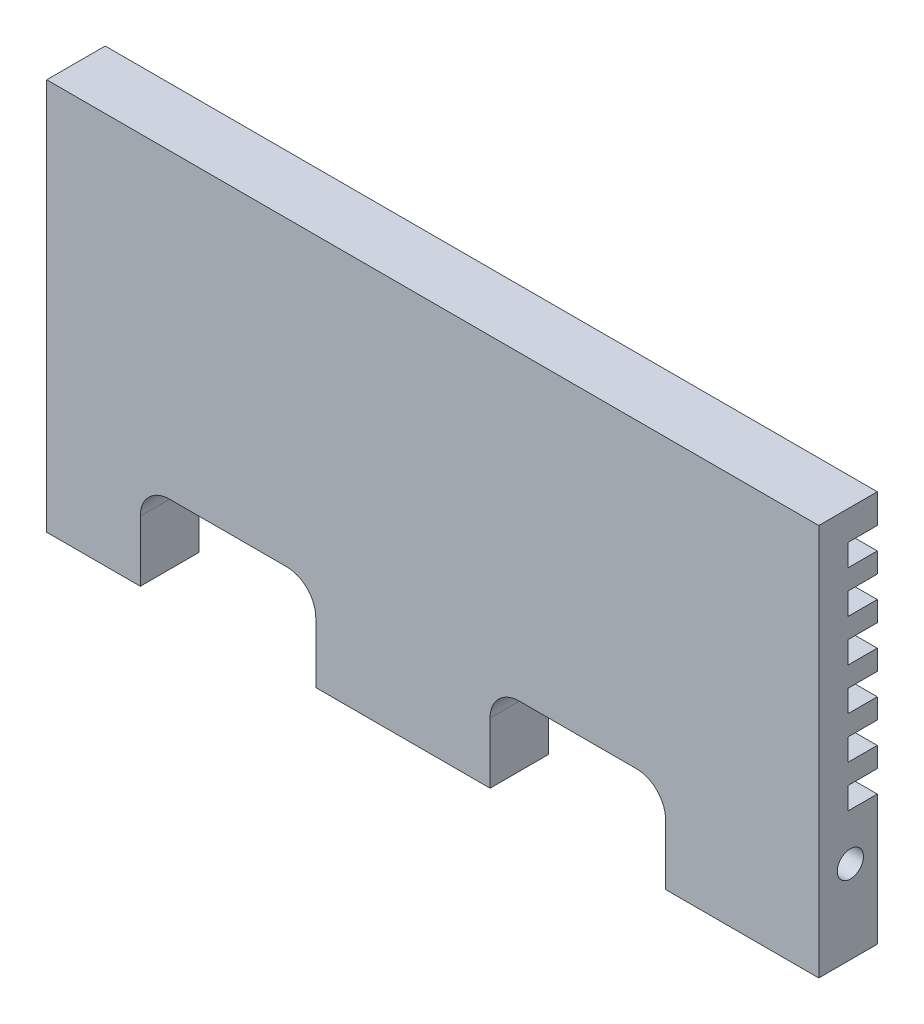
ISO-10303-21;
HEADER;
FILE_DESCRIPTION(('STEP AP214'),'2;1');
FILE_NAME('part.step','',(''),(''),'','','');
FILE_SCHEMA(('AUTOMOTIVE_DESIGN { 1 0 10303 214 1 1 1 1 }'));
ENDSEC;
DATA;
#1=APPLICATION_CONTEXT('core data for automotive mechanical design processes');
#2=APPLICATION_PROTOCOL_DEFINITION('international standard','automotive_design',2000,#1);
#3=PRODUCT_CONTEXT('',#1,'mechanical');
#4=PRODUCT('Part','Part','',(#3));
#5=PRODUCT_RELATED_PRODUCT_CATEGORY('part','',(#4));
#6=PRODUCT_DEFINITION_FORMATION('','',#4);
#7=PRODUCT_DEFINITION_CONTEXT('part definition',#1,'design');
#8=PRODUCT_DEFINITION('design','',#6,#7);
#9=PRODUCT_DEFINITION_SHAPE('','',#8);
#10=(LENGTH_UNIT() NAMED_UNIT(*) SI_UNIT(.MILLI.,.METRE.));
#11=(NAMED_UNIT(*) PLANE_ANGLE_UNIT() SI_UNIT($,.RADIAN.));
#12=(NAMED_UNIT(*) SI_UNIT($,.STERADIAN.) SOLID_ANGLE_UNIT());
#13=UNCERTAINTY_MEASURE_WITH_UNIT(LENGTH_MEASURE(1.E-05),#10,'distance_accuracy_value','');
#14=(GEOMETRIC_REPRESENTATION_CONTEXT(3) GLOBAL_UNCERTAINTY_ASSIGNED_CONTEXT((#13)) GLOBAL_UNIT_ASSIGNED_CONTEXT((#10,
#11,#12)) REPRESENTATION_CONTEXT('',''));
#15=CARTESIAN_POINT('',(0.,0.,0.));
#16=DIRECTION('',(0.,0.,1.));
#17=DIRECTION('',(1.,0.,0.));
#18=AXIS2_PLACEMENT_3D('',#15,#16,#17);
#19=CARTESIAN_POINT('',(-41.9099999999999,-25.4,-6.34999999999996));
#20=DIRECTION('',(0.,0.,1.));
#21=DIRECTION('',(1.,0.,0.));
#22=AXIS2_PLACEMENT_3D('',#19,#20,#21);
#23=PLANE('',#22);
#24=DIRECTION('',(0.,1.,0.));
#25=VECTOR('',#24,1.);
#26=CARTESIAN_POINT('',(41.91,25.4,-6.34999999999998));
#27=LINE('',#26,#25);
#28=CARTESIAN_POINT('',(41.91,-17.145,-6.34999999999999));
#29=VERTEX_POINT('',#28);
#30=CARTESIAN_POINT('',(41.91,-3.02259999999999,-6.34999999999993));
#31=VERTEX_POINT('',#30);
#32=EDGE_CURVE('E480',#29,#31,#27,.T.);
#33=ORIENTED_EDGE('',*,*,#32,.F.);
#34=DIRECTION('',(-1.,0.,0.));
#35=VECTOR('',#34,1.);
#36=CARTESIAN_POINT('',(-41.91,-17.145,-6.34999999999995));
#37=LINE('',#36,#35);
#38=CARTESIAN_POINT('',(25.273,-17.145,-6.34999999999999));
#39=VERTEX_POINT('',#38);
#40=EDGE_CURVE('E715',#29,#39,#37,.T.);
#41=ORIENTED_EDGE('',*,*,#40,.T.);
#42=DIRECTION('',(0.,-1.,0.));
#43=VECTOR('',#42,1.);
#44=CARTESIAN_POINT('',(25.273,-7.36599999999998,-6.34999999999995));
#45=LINE('',#44,#43);
#46=CARTESIAN_POINT('',(25.273,-10.541,-6.34999999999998));
#47=VERTEX_POINT('',#46);
#48=EDGE_CURVE('E517',#47,#39,#45,.T.);
#49=ORIENTED_EDGE('',*,*,#48,.F.);
#50=CARTESIAN_POINT('',(22.098,-10.541,-6.34999999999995));
#51=DIRECTION('',(0.,0.,1.));
#52=DIRECTION('',(1.,0.,0.));
#53=AXIS2_PLACEMENT_3D('',#50,#51,#52);
#54=CIRCLE('',#53,3.175);
#55=CARTESIAN_POINT('',(22.098,-7.36599999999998,-6.34999999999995));
#56=VERTEX_POINT('',#55);
#57=EDGE_CURVE('E361',#47,#56,#54,.T.);
#58=ORIENTED_EDGE('',*,*,#57,.T.);
#59=DIRECTION('',(1.,0.,0.));
#60=VECTOR('',#59,1.);
#61=CARTESIAN_POINT('',(25.273,-7.36599999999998,-6.34999999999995));
#62=LINE('',#61,#60);
#63=CARTESIAN_POINT('',(9.398,-7.36599999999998,-6.34999999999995));
#64=VERTEX_POINT('',#63);
#65=EDGE_CURVE('E512',#64,#56,#62,.T.);
#66=ORIENTED_EDGE('',*,*,#65,.F.);
#67=CARTESIAN_POINT('',(9.39799999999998,-10.541,-6.34999999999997));
#68=DIRECTION('',(0.,0.,1.));
#69=DIRECTION('',(1.,0.,0.));
#70=AXIS2_PLACEMENT_3D('',#67,#68,#69);
#71=CIRCLE('',#70,3.175);
#72=CARTESIAN_POINT('',(6.22299999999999,-10.541,-6.34999999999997));
#73=VERTEX_POINT('',#72);
#74=EDGE_CURVE('E347',#64,#73,#71,.T.);
#75=ORIENTED_EDGE('',*,*,#74,.T.);
#76=DIRECTION('',(0.,1.,0.));
#77=VECTOR('',#76,1.);
#78=CARTESIAN_POINT('',(6.22299999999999,-7.36599999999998,-6.34999999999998));
#79=LINE('',#78,#77);
#80=CARTESIAN_POINT('',(6.22299999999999,-17.145,-6.34999999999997));
#81=VERTEX_POINT('',#80);
#82=EDGE_CURVE('E515',#81,#73,#79,.T.);
#83=ORIENTED_EDGE('',*,*,#82,.F.);
#84=CARTESIAN_POINT('',(-12.7,-17.145,-6.34999999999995));
#85=VERTEX_POINT('',#84);
#86=EDGE_CURVE('E723',#81,#85,#37,.T.);
#87=ORIENTED_EDGE('',*,*,#86,.T.);
#88=DIRECTION('',(0.,-1.,0.));
#89=VECTOR('',#88,1.);
#90=CARTESIAN_POINT('',(-12.7,-7.36599999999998,-6.34999999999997));
#91=LINE('',#90,#89);
#92=CARTESIAN_POINT('',(-12.7,-10.541,-6.34999999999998));
#93=VERTEX_POINT('',#92);
#94=EDGE_CURVE('E531',#93,#85,#91,.T.);
#95=ORIENTED_EDGE('',*,*,#94,.F.);
#96=CARTESIAN_POINT('',(-15.875,-10.541,-6.34999999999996));
#97=DIRECTION('',(0.,0.,1.));
#98=DIRECTION('',(1.,0.,0.));
#99=AXIS2_PLACEMENT_3D('',#96,#97,#98);
#100=CIRCLE('',#99,3.175);
#101=CARTESIAN_POINT('',(-15.875,-7.36599999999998,-6.34999999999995));
#102=VERTEX_POINT('',#101);
#103=EDGE_CURVE('E357',#93,#102,#100,.T.);
#104=ORIENTED_EDGE('',*,*,#103,.T.);
#105=DIRECTION('',(1.,0.,0.));
#106=VECTOR('',#105,1.);
#107=CARTESIAN_POINT('',(-12.7,-7.36599999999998,-6.34999999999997));
#108=LINE('',#107,#106);
#109=CARTESIAN_POINT('',(-28.575,-7.36599999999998,-6.34999999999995));
#110=VERTEX_POINT('',#109);
#111=EDGE_CURVE('E526',#110,#102,#108,.T.);
#112=ORIENTED_EDGE('',*,*,#111,.F.);
#113=CARTESIAN_POINT('',(-28.575,-10.541,-6.34999999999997));
#114=DIRECTION('',(0.,0.,1.));
#115=DIRECTION('',(1.,0.,0.));
#116=AXIS2_PLACEMENT_3D('',#113,#114,#115);
#117=CIRCLE('',#116,3.175);
#118=CARTESIAN_POINT('',(-31.75,-10.541,-6.34999999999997));
#119=VERTEX_POINT('',#118);
#120=EDGE_CURVE('E352',#110,#119,#117,.T.);
#121=ORIENTED_EDGE('',*,*,#120,.T.);
#122=DIRECTION('',(0.,1.,0.));
#123=VECTOR('',#122,1.);
#124=CARTESIAN_POINT('',(-31.75,-7.36599999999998,-6.34999999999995));
#125=LINE('',#124,#123);
#126=CARTESIAN_POINT('',(-31.75,-17.145,-6.34999999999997));
#127=VERTEX_POINT('',#126);
#128=EDGE_CURVE('E529',#127,#119,#125,.T.);
#129=ORIENTED_EDGE('',*,*,#128,.F.);
#130=CARTESIAN_POINT('',(-41.91,-17.145,-6.34999999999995));
#131=VERTEX_POINT('',#130);
#132=EDGE_CURVE('E303',#127,#131,#37,.T.);
#133=ORIENTED_EDGE('',*,*,#132,.T.);
#134=DIRECTION('',(0.,-1.,0.));
#135=VECTOR('',#134,1.);
#136=CARTESIAN_POINT('',(-41.91,25.4,-6.34999999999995));
#137=LINE('',#136,#135);
#138=CARTESIAN_POINT('',(-41.91,-3.02259999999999,-6.34999999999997));
#139=VERTEX_POINT('',#138);
#140=EDGE_CURVE('E500',#139,#131,#137,.T.);
#141=ORIENTED_EDGE('',*,*,#140,.F.);
#142=DIRECTION('',(1.,0.,0.));
#143=VECTOR('',#142,1.);
#144=CARTESIAN_POINT('',(-41.91,-3.02259999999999,-6.34999999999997));
#145=LINE('',#144,#143);
#146=EDGE_CURVE('E665',#139,#31,#145,.T.);
#147=ORIENTED_EDGE('',*,*,#146,.T.);
#148=EDGE_LOOP('',(#33,#41,#49,#58,#66,#75,#83,#87,#95,#104,#112,#121,#129,#133,#141,#147));
#149=FACE_BOUND('',#148,.T.);
#150=ADVANCED_FACE('F34',(#149),#23,.F.);
#151=CARTESIAN_POINT('',(41.91,-0.634999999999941,-6.34999999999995));
#152=VERTEX_POINT('',#151);
#153=CARTESIAN_POINT('',(41.91,1.54940000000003,-6.34999999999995));
#154=VERTEX_POINT('',#153);
#155=EDGE_CURVE('E484',#152,#154,#27,.T.);
#156=ORIENTED_EDGE('',*,*,#155,.F.);
#157=DIRECTION('',(1.,0.,0.));
#158=VECTOR('',#157,1.);
#159=CARTESIAN_POINT('',(-41.91,-0.634999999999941,-6.34999999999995));
#160=LINE('',#159,#158);
#161=CARTESIAN_POINT('',(-41.91,-0.634999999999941,-6.34999999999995));
#162=VERTEX_POINT('',#161);
#163=EDGE_CURVE('E666',#162,#152,#160,.T.);
#164=ORIENTED_EDGE('',*,*,#163,.F.);
#165=CARTESIAN_POINT('',(-41.91,1.54940000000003,-6.34999999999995));
#166=VERTEX_POINT('',#165);
#167=EDGE_CURVE('E502',#166,#162,#137,.T.);
#168=ORIENTED_EDGE('',*,*,#167,.F.);
#169=DIRECTION('',(1.,0.,0.));
#170=VECTOR('',#169,1.);
#171=CARTESIAN_POINT('',(-41.91,1.54940000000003,-6.34999999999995));
#172=LINE('',#171,#170);
#173=EDGE_CURVE('E638',#166,#154,#172,.T.);
#174=ORIENTED_EDGE('',*,*,#173,.T.);
#175=EDGE_LOOP('',(#156,#164,#168,#174));
#176=FACE_BOUND('',#175,.T.);
#177=ADVANCED_FACE('F430',(#176),#23,.F.);
#178=CARTESIAN_POINT('',(41.91,3.93700000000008,-6.34999999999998));
#179=VERTEX_POINT('',#178);
#180=CARTESIAN_POINT('',(41.91,6.12140000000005,-6.35));
#181=VERTEX_POINT('',#180);
#182=EDGE_CURVE('E1157',#179,#181,#27,.T.);
#183=ORIENTED_EDGE('',*,*,#182,.F.);
#184=DIRECTION('',(1.,0.,0.));
#185=VECTOR('',#184,1.);
#186=CARTESIAN_POINT('',(-41.91,3.93699999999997,-6.34999999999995));
#187=LINE('',#186,#185);
#188=CARTESIAN_POINT('',(-41.91,3.93699999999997,-6.34999999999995));
#189=VERTEX_POINT('',#188);
#190=EDGE_CURVE('E639',#189,#179,#187,.T.);
#191=ORIENTED_EDGE('',*,*,#190,.F.);
#192=CARTESIAN_POINT('',(-41.91,6.12140000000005,-6.34999999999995));
#193=VERTEX_POINT('',#192);
#194=EDGE_CURVE('E1169',#193,#189,#137,.T.);
#195=ORIENTED_EDGE('',*,*,#194,.F.);
#196=DIRECTION('',(1.,0.,0.));
#197=VECTOR('',#196,1.);
#198=CARTESIAN_POINT('',(-41.91,6.12140000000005,-6.34999999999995));
#199=LINE('',#198,#197);
#200=EDGE_CURVE('E611',#193,#181,#199,.T.);
#201=ORIENTED_EDGE('',*,*,#200,.T.);
#202=EDGE_LOOP('',(#183,#191,#195,#201));
#203=FACE_BOUND('',#202,.T.);
#204=ADVANCED_FACE('F437',(#203),#23,.F.);
#205=CARTESIAN_POINT('',(41.91,8.50899999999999,-6.34999999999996));
#206=VERTEX_POINT('',#205);
#207=CARTESIAN_POINT('',(41.91,10.6934,-6.34999999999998));
#208=VERTEX_POINT('',#207);
#209=EDGE_CURVE('E478',#206,#208,#27,.T.);
#210=ORIENTED_EDGE('',*,*,#209,.F.);
#211=DIRECTION('',(1.,0.,0.));
#212=VECTOR('',#211,1.);
#213=CARTESIAN_POINT('',(-41.91,8.50899999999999,-6.34999999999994));
#214=LINE('',#213,#212);
#215=CARTESIAN_POINT('',(-41.91,8.50899999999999,-6.34999999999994));
#216=VERTEX_POINT('',#215);
#217=EDGE_CURVE('E612',#216,#206,#214,.T.);
#218=ORIENTED_EDGE('',*,*,#217,.F.);
#219=CARTESIAN_POINT('',(-41.91,10.6934,-6.34999999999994));
#220=VERTEX_POINT('',#219);
#221=EDGE_CURVE('E1171',#220,#216,#137,.T.);
#222=ORIENTED_EDGE('',*,*,#221,.F.);
#223=DIRECTION('',(1.,0.,0.));
#224=VECTOR('',#223,1.);
#225=CARTESIAN_POINT('',(-41.91,10.6934,-6.34999999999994));
#226=LINE('',#225,#224);
#227=EDGE_CURVE('E584',#220,#208,#226,.T.);
#228=ORIENTED_EDGE('',*,*,#227,.T.);
#229=EDGE_LOOP('',(#210,#218,#222,#228));
#230=FACE_BOUND('',#229,.T.);
#231=ADVANCED_FACE('F462',(#230),#23,.F.);
#232=CARTESIAN_POINT('',(41.91,13.081,-6.34999999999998));
#233=VERTEX_POINT('',#232);
#234=CARTESIAN_POINT('',(41.91,15.2654,-6.35));
#235=VERTEX_POINT('',#234);
#236=EDGE_CURVE('E475',#233,#235,#27,.T.);
#237=ORIENTED_EDGE('',*,*,#236,.F.);
#238=DIRECTION('',(1.,0.,0.));
#239=VECTOR('',#238,1.);
#240=CARTESIAN_POINT('',(-41.91,13.081,-6.34999999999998));
#241=LINE('',#240,#239);
#242=CARTESIAN_POINT('',(-41.91,13.081,-6.34999999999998));
#243=VERTEX_POINT('',#242);
#244=EDGE_CURVE('E585',#243,#233,#241,.T.);
#245=ORIENTED_EDGE('',*,*,#244,.F.);
#246=CARTESIAN_POINT('',(-41.91,15.2654,-6.34999999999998));
#247=VERTEX_POINT('',#246);
#248=EDGE_CURVE('E1173',#247,#243,#137,.T.);
#249=ORIENTED_EDGE('',*,*,#248,.F.);
#250=DIRECTION('',(1.,0.,0.));
#251=VECTOR('',#250,1.);
#252=CARTESIAN_POINT('',(-41.91,15.2654,-6.34999999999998));
#253=LINE('',#252,#251);
#254=EDGE_CURVE('E558',#247,#235,#253,.T.);
#255=ORIENTED_EDGE('',*,*,#254,.T.);
#256=EDGE_LOOP('',(#237,#245,#249,#255));
#257=FACE_BOUND('',#256,.T.);
#258=ADVANCED_FACE('F455',(#257),#23,.F.);
#259=CARTESIAN_POINT('',(41.9100000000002,17.653,-6.34999999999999));
#260=VERTEX_POINT('',#259);
#261=CARTESIAN_POINT('',(41.9100000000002,19.8374,-6.34999999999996));
#262=VERTEX_POINT('',#261);
#263=EDGE_CURVE('E467',#260,#262,#27,.T.);
#264=ORIENTED_EDGE('',*,*,#263,.F.);
#265=DIRECTION('',(1.,0.,0.));
#266=VECTOR('',#265,1.);
#267=CARTESIAN_POINT('',(-41.9099999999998,17.653,-6.34999999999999));
#268=LINE('',#267,#266);
#269=CARTESIAN_POINT('',(-41.9099999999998,17.653,-6.34999999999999));
#270=VERTEX_POINT('',#269);
#271=EDGE_CURVE('E469',#270,#260,#268,.T.);
#272=ORIENTED_EDGE('',*,*,#271,.F.);
#273=CARTESIAN_POINT('',(-41.9099999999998,19.8374,-6.34999999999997));
#274=VERTEX_POINT('',#273);
#275=EDGE_CURVE('E1175',#274,#270,#137,.T.);
#276=ORIENTED_EDGE('',*,*,#275,.F.);
#277=DIRECTION('',(1.,0.,0.));
#278=VECTOR('',#277,1.);
#279=CARTESIAN_POINT('',(-41.9099999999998,19.8374,-6.34999999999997));
#280=LINE('',#279,#278);
#281=EDGE_CURVE('E471',#274,#262,#280,.T.);
#282=ORIENTED_EDGE('',*,*,#281,.T.);
#283=EDGE_LOOP('',(#264,#272,#276,#282));
#284=FACE_BOUND('',#283,.T.);
#285=ADVANCED_FACE('F445',(#284),#23,.F.);
#286=CARTESIAN_POINT('',(-41.91,25.4,-6.34999999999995));
#287=DIRECTION('',(-1.,0.,0.));
#288=DIRECTION('',(0.,0.,1.));
#289=AXIS2_PLACEMENT_3D('',#286,#287,#288);
#290=PLANE('',#289);
#291=DIRECTION('',(0.,0.,-1.));
#292=VECTOR('',#291,1.);
#293=CARTESIAN_POINT('',(-41.91,-17.145,-6.34999999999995));
#294=LINE('',#293,#292);
#295=CARTESIAN_POINT('',(-41.91,-17.145,0.));
#296=VERTEX_POINT('',#295);
#297=EDGE_CURVE('E316',#296,#131,#294,.T.);
#298=ORIENTED_EDGE('',*,*,#297,.F.);
#299=DIRECTION('',(0.,-1.,0.));
#300=VECTOR('',#299,1.);
#301=CARTESIAN_POINT('',(-41.91,25.4,0.));
#302=LINE('',#301,#300);
#303=CARTESIAN_POINT('',(-41.91,25.4,0.));
#304=VERTEX_POINT('',#303);
#305=EDGE_CURVE('E315',#304,#296,#302,.T.);
#306=ORIENTED_EDGE('',*,*,#305,.F.);
#307=DIRECTION('',(0.,0.,1.));
#308=VECTOR('',#307,1.);
#309=CARTESIAN_POINT('',(-41.91,25.4,-6.34999999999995));
#310=LINE('',#309,#308);
#311=CARTESIAN_POINT('',(-41.91,25.4,-6.34999999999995));
#312=VERTEX_POINT('',#311);
#313=EDGE_CURVE('E327',#312,#304,#310,.T.);
#314=ORIENTED_EDGE('',*,*,#313,.F.);
#315=CARTESIAN_POINT('',(-41.91,22.2250000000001,-6.34999999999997));
#316=VERTEX_POINT('',#315);
#317=EDGE_CURVE('E479',#312,#316,#137,.T.);
#318=ORIENTED_EDGE('',*,*,#317,.T.);
#319=DIRECTION('',(0.,0.,1.));
#320=VECTOR('',#319,1.);
#321=CARTESIAN_POINT('',(-41.91,22.2250000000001,-6.34999999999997));
#322=LINE('',#321,#320);
#323=CARTESIAN_POINT('',(-41.91,22.2249999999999,-3.17499999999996));
#324=VERTEX_POINT('',#323);
#325=EDGE_CURVE('E547',#316,#324,#322,.T.);
#326=ORIENTED_EDGE('',*,*,#325,.T.);
#327=DIRECTION('',(0.,-1.,0.));
#328=VECTOR('',#327,1.);
#329=CARTESIAN_POINT('',(-41.91,22.2249999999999,-3.17499999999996));
#330=LINE('',#329,#328);
#331=CARTESIAN_POINT('',(-41.91,19.8374,-3.17499999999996));
#332=VERTEX_POINT('',#331);
#333=EDGE_CURVE('E544',#324,#332,#330,.T.);
#334=ORIENTED_EDGE('',*,*,#333,.T.);
#335=DIRECTION('',(0.,0.,-1.));
#336=VECTOR('',#335,1.);
#337=CARTESIAN_POINT('',(-41.9099999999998,19.8374,-6.34999999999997));
#338=LINE('',#337,#336);
#339=EDGE_CURVE('E537',#332,#274,#338,.T.);
#340=ORIENTED_EDGE('',*,*,#339,.T.);
#341=ORIENTED_EDGE('',*,*,#275,.T.);
#342=DIRECTION('',(0.,0.,1.));
#343=VECTOR('',#342,1.);
#344=CARTESIAN_POINT('',(-41.9099999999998,17.653,-6.34999999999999));
#345=LINE('',#344,#343);
#346=CARTESIAN_POINT('',(-41.91,17.6529999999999,-3.17499999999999));
#347=VERTEX_POINT('',#346);
#348=EDGE_CURVE('E572',#270,#347,#345,.T.);
#349=ORIENTED_EDGE('',*,*,#348,.T.);
#350=DIRECTION('',(0.,-1.,0.));
#351=VECTOR('',#350,1.);
#352=CARTESIAN_POINT('',(-41.91,17.6529999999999,-3.17499999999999));
#353=LINE('',#352,#351);
#354=CARTESIAN_POINT('',(-41.91,15.2654,-3.17499999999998));
#355=VERTEX_POINT('',#354);
#356=EDGE_CURVE('E569',#347,#355,#353,.T.);
#357=ORIENTED_EDGE('',*,*,#356,.T.);
#358=DIRECTION('',(0.,0.,-1.));
#359=VECTOR('',#358,1.);
#360=CARTESIAN_POINT('',(-41.91,15.2654,-6.34999999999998));
#361=LINE('',#360,#359);
#362=EDGE_CURVE('E561',#355,#247,#361,.T.);
#363=ORIENTED_EDGE('',*,*,#362,.T.);
#364=ORIENTED_EDGE('',*,*,#248,.T.);
#365=DIRECTION('',(0.,0.,1.));
#366=VECTOR('',#365,1.);
#367=CARTESIAN_POINT('',(-41.91,13.081,-6.34999999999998));
#368=LINE('',#367,#366);
#369=CARTESIAN_POINT('',(-41.91,13.081,-3.17499999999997));
#370=VERTEX_POINT('',#369);
#371=EDGE_CURVE('E599',#243,#370,#368,.T.);
#372=ORIENTED_EDGE('',*,*,#371,.T.);
#373=DIRECTION('',(0.,-1.,0.));
#374=VECTOR('',#373,1.);
#375=CARTESIAN_POINT('',(-41.91,13.081,-3.17499999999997));
#376=LINE('',#375,#374);
#377=CARTESIAN_POINT('',(-41.91,10.6934,-3.17499999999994));
#378=VERTEX_POINT('',#377);
#379=EDGE_CURVE('E596',#370,#378,#376,.T.);
#380=ORIENTED_EDGE('',*,*,#379,.T.);
#381=DIRECTION('',(0.,0.,-1.));
#382=VECTOR('',#381,1.);
#383=CARTESIAN_POINT('',(-41.91,10.6934,-6.34999999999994));
#384=LINE('',#383,#382);
#385=EDGE_CURVE('E588',#378,#220,#384,.T.);
#386=ORIENTED_EDGE('',*,*,#385,.T.);
#387=ORIENTED_EDGE('',*,*,#221,.T.);
#388=DIRECTION('',(0.,0.,1.));
#389=VECTOR('',#388,1.);
#390=CARTESIAN_POINT('',(-41.91,8.50899999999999,-6.34999999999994));
#391=LINE('',#390,#389);
#392=CARTESIAN_POINT('',(-41.91,8.50899999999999,-3.17499999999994));
#393=VERTEX_POINT('',#392);
#394=EDGE_CURVE('E626',#216,#393,#391,.T.);
#395=ORIENTED_EDGE('',*,*,#394,.T.);
#396=DIRECTION('',(0.,-1.,0.));
#397=VECTOR('',#396,1.);
#398=CARTESIAN_POINT('',(-41.91,8.50899999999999,-3.17499999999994));
#399=LINE('',#398,#397);
#400=CARTESIAN_POINT('',(-41.91,6.12139999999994,-3.17499999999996));
#401=VERTEX_POINT('',#400);
#402=EDGE_CURVE('E623',#393,#401,#399,.T.);
#403=ORIENTED_EDGE('',*,*,#402,.T.);
#404=DIRECTION('',(0.,0.,-1.));
#405=VECTOR('',#404,1.);
#406=CARTESIAN_POINT('',(-41.91,6.12140000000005,-6.34999999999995));
#407=LINE('',#406,#405);
#408=EDGE_CURVE('E615',#401,#193,#407,.T.);
#409=ORIENTED_EDGE('',*,*,#408,.T.);
#410=ORIENTED_EDGE('',*,*,#194,.T.);
#411=DIRECTION('',(0.,0.,1.));
#412=VECTOR('',#411,1.);
#413=CARTESIAN_POINT('',(-41.91,3.93699999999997,-6.34999999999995));
#414=LINE('',#413,#412);
#415=CARTESIAN_POINT('',(-41.91,3.93699999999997,-3.17499999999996));
#416=VERTEX_POINT('',#415);
#417=EDGE_CURVE('E653',#189,#416,#414,.T.);
#418=ORIENTED_EDGE('',*,*,#417,.T.);
#419=DIRECTION('',(0.,-1.,0.));
#420=VECTOR('',#419,1.);
#421=CARTESIAN_POINT('',(-41.91,3.93699999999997,-3.17499999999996));
#422=LINE('',#421,#420);
#423=CARTESIAN_POINT('',(-41.91,1.54940000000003,-3.17499999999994));
#424=VERTEX_POINT('',#423);
#425=EDGE_CURVE('E650',#416,#424,#422,.T.);
#426=ORIENTED_EDGE('',*,*,#425,.T.);
#427=DIRECTION('',(0.,0.,-1.));
#428=VECTOR('',#427,1.);
#429=CARTESIAN_POINT('',(-41.91,1.54940000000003,-6.34999999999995));
#430=LINE('',#429,#428);
#431=EDGE_CURVE('E642',#424,#166,#430,.T.);
#432=ORIENTED_EDGE('',*,*,#431,.T.);
#433=ORIENTED_EDGE('',*,*,#167,.T.);
#434=DIRECTION('',(0.,0.,1.));
#435=VECTOR('',#434,1.);
#436=CARTESIAN_POINT('',(-41.91,-0.634999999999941,-6.34999999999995));
#437=LINE('',#436,#435);
#438=CARTESIAN_POINT('',(-41.91,-0.634999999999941,-3.17499999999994));
#439=VERTEX_POINT('',#438);
#440=EDGE_CURVE('E680',#162,#439,#437,.T.);
#441=ORIENTED_EDGE('',*,*,#440,.T.);
#442=DIRECTION('',(0.,-1.,0.));
#443=VECTOR('',#442,1.);
#444=CARTESIAN_POINT('',(-41.91,-0.634999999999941,-3.17499999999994));
#445=LINE('',#444,#443);
#446=CARTESIAN_POINT('',(-41.91,-3.02259999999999,-3.17499999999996));
#447=VERTEX_POINT('',#446);
#448=EDGE_CURVE('E677',#439,#447,#445,.T.);
#449=ORIENTED_EDGE('',*,*,#448,.T.);
#450=DIRECTION('',(0.,0.,-1.));
#451=VECTOR('',#450,1.);
#452=CARTESIAN_POINT('',(-41.91,-3.02259999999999,-6.34999999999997));
#453=LINE('',#452,#451);
#454=EDGE_CURVE('E669',#447,#139,#453,.T.);
#455=ORIENTED_EDGE('',*,*,#454,.T.);
#456=ORIENTED_EDGE('',*,*,#140,.T.);
#457=EDGE_LOOP('',(#298,#306,#314,#318,#326,#334,#340,#341,#349,#357,#363,#364,#372,#380,#386,
#387,#395,#403,#409,#410,#418,#426,#432,#433,#441,#449,#455,#456));
#458=FACE_BOUND('',#457,.T.);
#459=CARTESIAN_POINT('',(-41.91,-8.12800000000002,-3.42899999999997));
#460=DIRECTION('',(-1.,0.,0.));
#461=DIRECTION('',(0.,0.,1.));
#462=AXIS2_PLACEMENT_3D('',#459,#460,#461);
#463=CIRCLE('',#462,1.42239999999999);
#464=CARTESIAN_POINT('',(-41.91,-8.12800000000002,-2.00659999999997));
#465=VERTEX_POINT('',#464);
#466=EDGE_CURVE('E704',#465,#465,#463,.T.);
#467=ORIENTED_EDGE('',*,*,#466,.F.);
#468=EDGE_LOOP('',(#467));
#469=FACE_BOUND('',#468,.T.);
#470=ADVANCED_FACE('F36',(#458,#469),#290,.T.);
#471=CARTESIAN_POINT('',(-41.91,25.4,-6.34999999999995));
#472=DIRECTION('',(0.,1.,0.));
#473=DIRECTION('',(0.,0.,1.));
#474=AXIS2_PLACEMENT_3D('',#471,#472,#473);
#475=PLANE('',#474);
#476=DIRECTION('',(-1.,0.,0.));
#477=VECTOR('',#476,1.);
#478=CARTESIAN_POINT('',(-41.91,25.4,0.));
#479=LINE('',#478,#477);
#480=CARTESIAN_POINT('',(41.91,25.4,0.));
#481=VERTEX_POINT('',#480);
#482=EDGE_CURVE('E499',#481,#304,#479,.T.);
#483=ORIENTED_EDGE('',*,*,#482,.F.);
#484=DIRECTION('',(0.,0.,1.));
#485=VECTOR('',#484,1.);
#486=CARTESIAN_POINT('',(41.91,25.4,-6.34999999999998));
#487=LINE('',#486,#485);
#488=CARTESIAN_POINT('',(41.91,25.4,-6.34999999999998));
#489=VERTEX_POINT('',#488);
#490=EDGE_CURVE('E488',#489,#481,#487,.T.);
#491=ORIENTED_EDGE('',*,*,#490,.F.);
#492=DIRECTION('',(-1.,0.,0.));
#493=VECTOR('',#492,1.);
#494=CARTESIAN_POINT('',(-41.91,25.4,-6.34999999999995));
#495=LINE('',#494,#493);
#496=EDGE_CURVE('E483',#489,#312,#495,.T.);
#497=ORIENTED_EDGE('',*,*,#496,.T.);
#498=ORIENTED_EDGE('',*,*,#313,.T.);
#499=EDGE_LOOP('',(#483,#491,#497,#498));
#500=FACE_BOUND('',#499,.T.);
#501=ADVANCED_FACE('F451',(#500),#475,.T.);
#502=CARTESIAN_POINT('',(41.91,25.4,-6.34999999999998));
#503=DIRECTION('',(1.,0.,0.));
#504=DIRECTION('',(0.,0.,-1.));
#505=AXIS2_PLACEMENT_3D('',#502,#503,#504);
#506=PLANE('',#505);
#507=DIRECTION('',(0.,0.,1.));
#508=VECTOR('',#507,1.);
#509=CARTESIAN_POINT('',(41.91,-17.145,-6.34999999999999));
#510=LINE('',#509,#508);
#511=CARTESIAN_POINT('',(41.91,-17.145,0.));
#512=VERTEX_POINT('',#511);
#513=EDGE_CURVE('E716',#29,#512,#510,.T.);
#514=ORIENTED_EDGE('',*,*,#513,.F.);
#515=ORIENTED_EDGE('',*,*,#32,.T.);
#516=DIRECTION('',(0.,0.,-1.));
#517=VECTOR('',#516,1.);
#518=CARTESIAN_POINT('',(41.91,-3.02259999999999,-6.34999999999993));
#519=LINE('',#518,#517);
#520=CARTESIAN_POINT('',(41.91,-3.02259999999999,-3.17499999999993));
#521=VERTEX_POINT('',#520);
#522=EDGE_CURVE('E683',#521,#31,#519,.T.);
#523=ORIENTED_EDGE('',*,*,#522,.F.);
#524=DIRECTION('',(0.,-1.,0.));
#525=VECTOR('',#524,1.);
#526=CARTESIAN_POINT('',(41.91,-0.634999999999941,-3.17499999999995));
#527=LINE('',#526,#525);
#528=CARTESIAN_POINT('',(41.91,-0.634999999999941,-3.17499999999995));
#529=VERTEX_POINT('',#528);
#530=EDGE_CURVE('E686',#529,#521,#527,.T.);
#531=ORIENTED_EDGE('',*,*,#530,.F.);
#532=DIRECTION('',(0.,0.,1.));
#533=VECTOR('',#532,1.);
#534=CARTESIAN_POINT('',(41.91,-0.634999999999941,-6.34999999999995));
#535=LINE('',#534,#533);
#536=EDGE_CURVE('E689',#152,#529,#535,.T.);
#537=ORIENTED_EDGE('',*,*,#536,.F.);
#538=ORIENTED_EDGE('',*,*,#155,.T.);
#539=DIRECTION('',(0.,0.,-1.));
#540=VECTOR('',#539,1.);
#541=CARTESIAN_POINT('',(41.91,1.54940000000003,-6.34999999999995));
#542=LINE('',#541,#540);
#543=CARTESIAN_POINT('',(41.91,1.54940000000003,-3.17499999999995));
#544=VERTEX_POINT('',#543);
#545=EDGE_CURVE('E656',#544,#154,#542,.T.);
#546=ORIENTED_EDGE('',*,*,#545,.F.);
#547=DIRECTION('',(0.,-1.,0.));
#548=VECTOR('',#547,1.);
#549=CARTESIAN_POINT('',(41.91,3.93699999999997,-3.17499999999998));
#550=LINE('',#549,#548);
#551=CARTESIAN_POINT('',(41.91,3.93699999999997,-3.17499999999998));
#552=VERTEX_POINT('',#551);
#553=EDGE_CURVE('E659',#552,#544,#550,.T.);
#554=ORIENTED_EDGE('',*,*,#553,.F.);
#555=DIRECTION('',(0.,0.,1.));
#556=VECTOR('',#555,1.);
#557=CARTESIAN_POINT('',(41.91,3.93700000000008,-6.34999999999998));
#558=LINE('',#557,#556);
#559=EDGE_CURVE('E662',#179,#552,#558,.T.);
#560=ORIENTED_EDGE('',*,*,#559,.F.);
#561=ORIENTED_EDGE('',*,*,#182,.T.);
#562=DIRECTION('',(0.,0.,-1.));
#563=VECTOR('',#562,1.);
#564=CARTESIAN_POINT('',(41.91,6.12140000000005,-6.35));
#565=LINE('',#564,#563);
#566=CARTESIAN_POINT('',(41.91,6.12139999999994,-3.175));
#567=VERTEX_POINT('',#566);
#568=EDGE_CURVE('E629',#567,#181,#565,.T.);
#569=ORIENTED_EDGE('',*,*,#568,.F.);
#570=DIRECTION('',(0.,-1.,0.));
#571=VECTOR('',#570,1.);
#572=CARTESIAN_POINT('',(41.91,8.50899999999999,-3.17499999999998));
#573=LINE('',#572,#571);
#574=CARTESIAN_POINT('',(41.91,8.50899999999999,-3.17499999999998));
#575=VERTEX_POINT('',#574);
#576=EDGE_CURVE('E632',#575,#567,#573,.T.);
#577=ORIENTED_EDGE('',*,*,#576,.F.);
#578=DIRECTION('',(0.,0.,1.));
#579=VECTOR('',#578,1.);
#580=CARTESIAN_POINT('',(41.91,8.50899999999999,-6.34999999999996));
#581=LINE('',#580,#579);
#582=EDGE_CURVE('E635',#206,#575,#581,.T.);
#583=ORIENTED_EDGE('',*,*,#582,.F.);
#584=ORIENTED_EDGE('',*,*,#209,.T.);
#585=DIRECTION('',(0.,0.,-1.));
#586=VECTOR('',#585,1.);
#587=CARTESIAN_POINT('',(41.91,10.6934,-6.34999999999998));
#588=LINE('',#587,#586);
#589=CARTESIAN_POINT('',(41.91,10.6934,-3.17499999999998));
#590=VERTEX_POINT('',#589);
#591=EDGE_CURVE('E602',#590,#208,#588,.T.);
#592=ORIENTED_EDGE('',*,*,#591,.F.);
#593=DIRECTION('',(0.,-1.,0.));
#594=VECTOR('',#593,1.);
#595=CARTESIAN_POINT('',(41.91,13.081,-3.17499999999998));
#596=LINE('',#595,#594);
#597=CARTESIAN_POINT('',(41.91,13.081,-3.17499999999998));
#598=VERTEX_POINT('',#597);
#599=EDGE_CURVE('E605',#598,#590,#596,.T.);
#600=ORIENTED_EDGE('',*,*,#599,.F.);
#601=DIRECTION('',(0.,0.,1.));
#602=VECTOR('',#601,1.);
#603=CARTESIAN_POINT('',(41.91,13.081,-6.34999999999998));
#604=LINE('',#603,#602);
#605=EDGE_CURVE('E608',#233,#598,#604,.T.);
#606=ORIENTED_EDGE('',*,*,#605,.F.);
#607=ORIENTED_EDGE('',*,*,#236,.T.);
#608=DIRECTION('',(0.,0.,-1.));
#609=VECTOR('',#608,1.);
#610=CARTESIAN_POINT('',(41.91,15.2654,-6.35));
#611=LINE('',#610,#609);
#612=CARTESIAN_POINT('',(41.91,15.2654,-3.17499999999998));
#613=VERTEX_POINT('',#612);
#614=EDGE_CURVE('E575',#613,#235,#611,.T.);
#615=ORIENTED_EDGE('',*,*,#614,.F.);
#616=DIRECTION('',(0.,-1.,0.));
#617=VECTOR('',#616,1.);
#618=CARTESIAN_POINT('',(41.91,17.653,-3.175));
#619=LINE('',#618,#617);
#620=CARTESIAN_POINT('',(41.91,17.653,-3.175));
#621=VERTEX_POINT('',#620);
#622=EDGE_CURVE('E578',#621,#613,#619,.T.);
#623=ORIENTED_EDGE('',*,*,#622,.F.);
#624=DIRECTION('',(0.,0.,1.));
#625=VECTOR('',#624,1.);
#626=CARTESIAN_POINT('',(41.9100000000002,17.653,-6.34999999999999));
#627=LINE('',#626,#625);
#628=EDGE_CURVE('E581',#260,#621,#627,.T.);
#629=ORIENTED_EDGE('',*,*,#628,.F.);
#630=ORIENTED_EDGE('',*,*,#263,.T.);
#631=DIRECTION('',(0.,0.,-1.));
#632=VECTOR('',#631,1.);
#633=CARTESIAN_POINT('',(41.9100000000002,19.8374,-6.34999999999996));
#634=LINE('',#633,#632);
#635=CARTESIAN_POINT('',(41.91,19.8374,-3.17499999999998));
#636=VERTEX_POINT('',#635);
#637=EDGE_CURVE('E550',#636,#262,#634,.T.);
#638=ORIENTED_EDGE('',*,*,#637,.F.);
#639=DIRECTION('',(0.,-1.,0.));
#640=VECTOR('',#639,1.);
#641=CARTESIAN_POINT('',(41.91,22.2250000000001,-3.17499999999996));
#642=LINE('',#641,#640);
#643=CARTESIAN_POINT('',(41.91,22.2250000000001,-3.17499999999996));
#644=VERTEX_POINT('',#643);
#645=EDGE_CURVE('E552',#644,#636,#642,.T.);
#646=ORIENTED_EDGE('',*,*,#645,.F.);
#647=DIRECTION('',(0.,0.,1.));
#648=VECTOR('',#647,1.);
#649=CARTESIAN_POINT('',(41.91,22.2250000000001,-6.34999999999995));
#650=LINE('',#649,#648);
#651=CARTESIAN_POINT('',(41.91,22.2250000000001,-6.34999999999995));
#652=VERTEX_POINT('',#651);
#653=EDGE_CURVE('E555',#652,#644,#650,.T.);
#654=ORIENTED_EDGE('',*,*,#653,.F.);
#655=EDGE_CURVE('E476',#652,#489,#27,.T.);
#656=ORIENTED_EDGE('',*,*,#655,.T.);
#657=ORIENTED_EDGE('',*,*,#490,.T.);
#658=DIRECTION('',(0.,1.,0.));
#659=VECTOR('',#658,1.);
#660=CARTESIAN_POINT('',(41.91,25.4,0.));
#661=LINE('',#660,#659);
#662=EDGE_CURVE('E495',#512,#481,#661,.T.);
#663=ORIENTED_EDGE('',*,*,#662,.F.);
#664=EDGE_LOOP('',(#514,#515,#523,#531,#537,#538,#546,#554,#560,#561,#569,#577,#583,#584,#592,
#600,#606,#607,#615,#623,#629,#630,#638,#646,#654,#656,#657,#663));
#665=FACE_BOUND('',#664,.T.);
#666=CARTESIAN_POINT('',(41.91,-8.12800000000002,-3.42899999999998));
#667=DIRECTION('',(1.,0.,0.));
#668=DIRECTION('',(0.,0.,-1.));
#669=AXIS2_PLACEMENT_3D('',#666,#667,#668);
#670=CIRCLE('',#669,1.42239999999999);
#671=CARTESIAN_POINT('',(41.91,-8.12800000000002,-4.85139999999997));
#672=VERTEX_POINT('',#671);
#673=EDGE_CURVE('E692',#672,#672,#670,.T.);
#674=ORIENTED_EDGE('',*,*,#673,.F.);
#675=EDGE_LOOP('',(#674));
#676=FACE_BOUND('',#675,.T.);
#677=ADVANCED_FACE('F443',(#665,#676),#506,.T.);
#678=ORIENTED_EDGE('',*,*,#655,.F.);
#679=DIRECTION('',(1.,0.,0.));
#680=VECTOR('',#679,1.);
#681=CARTESIAN_POINT('',(-41.91,22.2250000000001,-6.34999999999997));
#682=LINE('',#681,#680);
#683=EDGE_CURVE('E534',#316,#652,#682,.T.);
#684=ORIENTED_EDGE('',*,*,#683,.F.);
#685=ORIENTED_EDGE('',*,*,#317,.F.);
#686=ORIENTED_EDGE('',*,*,#496,.F.);
#687=EDGE_LOOP('',(#678,#684,#685,#686));
#688=FACE_BOUND('',#687,.T.);
#689=ADVANCED_FACE('F433',(#688),#23,.F.);
#690=CARTESIAN_POINT('',(-41.9099999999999,-25.4,0.));
#691=DIRECTION('',(0.,0.,1.));
#692=DIRECTION('',(1.,0.,0.));
#693=AXIS2_PLACEMENT_3D('',#690,#691,#692);
#694=PLANE('',#693);
#695=DIRECTION('',(-1.,0.,0.));
#696=VECTOR('',#695,1.);
#697=CARTESIAN_POINT('',(-41.91,-17.145,0.));
#698=LINE('',#697,#696);
#699=CARTESIAN_POINT('',(25.273,-17.145,0.));
#700=VERTEX_POINT('',#699);
#701=EDGE_CURVE('E49',#512,#700,#698,.T.);
#702=ORIENTED_EDGE('',*,*,#701,.F.);
#703=ORIENTED_EDGE('',*,*,#662,.T.);
#704=ORIENTED_EDGE('',*,*,#482,.T.);
#705=ORIENTED_EDGE('',*,*,#305,.T.);
#706=CARTESIAN_POINT('',(-31.75,-17.145,0.));
#707=VERTEX_POINT('',#706);
#708=EDGE_CURVE('E300',#707,#296,#698,.T.);
#709=ORIENTED_EDGE('',*,*,#708,.F.);
#710=DIRECTION('',(0.,-1.,0.));
#711=VECTOR('',#710,1.);
#712=CARTESIAN_POINT('',(-31.7499999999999,-25.4,0.));
#713=LINE('',#712,#711);
#714=CARTESIAN_POINT('',(-31.75,-10.541,0.));
#715=VERTEX_POINT('',#714);
#716=EDGE_CURVE('E311',#715,#707,#713,.T.);
#717=ORIENTED_EDGE('',*,*,#716,.F.);
#718=CARTESIAN_POINT('',(-28.575,-10.541,0.));
#719=DIRECTION('',(0.,0.,1.));
#720=DIRECTION('',(1.,0.,0.));
#721=AXIS2_PLACEMENT_3D('',#718,#719,#720);
#722=CIRCLE('',#721,3.175);
#723=CARTESIAN_POINT('',(-28.575,-7.36599999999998,0.));
#724=VERTEX_POINT('',#723);
#725=EDGE_CURVE('E355',#715,#724,#722,.F.);
#726=ORIENTED_EDGE('',*,*,#725,.T.);
#727=DIRECTION('',(1.,0.,0.));
#728=VECTOR('',#727,1.);
#729=CARTESIAN_POINT('',(-12.7,-7.36599999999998,0.));
#730=LINE('',#729,#728);
#731=CARTESIAN_POINT('',(-15.875,-7.36599999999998,0.));
#732=VERTEX_POINT('',#731);
#733=EDGE_CURVE('E520',#724,#732,#730,.T.);
#734=ORIENTED_EDGE('',*,*,#733,.T.);
#735=CARTESIAN_POINT('',(-15.875,-10.5409999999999,0.));
#736=DIRECTION('',(0.,0.,1.));
#737=DIRECTION('',(1.,0.,0.));
#738=AXIS2_PLACEMENT_3D('',#735,#736,#737);
#739=CIRCLE('',#738,3.175);
#740=CARTESIAN_POINT('',(-12.7,-10.5409999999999,0.));
#741=VERTEX_POINT('',#740);
#742=EDGE_CURVE('E359',#732,#741,#739,.F.);
#743=ORIENTED_EDGE('',*,*,#742,.T.);
#744=DIRECTION('',(0.,-1.,0.));
#745=VECTOR('',#744,1.);
#746=CARTESIAN_POINT('',(-12.7,-7.36599999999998,0.));
#747=LINE('',#746,#745);
#748=CARTESIAN_POINT('',(-12.7,-17.145,0.));
#749=VERTEX_POINT('',#748);
#750=EDGE_CURVE('E523',#741,#749,#747,.T.);
#751=ORIENTED_EDGE('',*,*,#750,.T.);
#752=CARTESIAN_POINT('',(6.22299999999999,-17.145,0.));
#753=VERTEX_POINT('',#752);
#754=EDGE_CURVE('E57',#753,#749,#698,.T.);
#755=ORIENTED_EDGE('',*,*,#754,.F.);
#756=DIRECTION('',(0.,-1.,0.));
#757=VECTOR('',#756,1.);
#758=CARTESIAN_POINT('',(6.22300000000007,-25.4,0.));
#759=LINE('',#758,#757);
#760=CARTESIAN_POINT('',(6.22299999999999,-10.541,0.));
#761=VERTEX_POINT('',#760);
#762=EDGE_CURVE('E322',#761,#753,#759,.T.);
#763=ORIENTED_EDGE('',*,*,#762,.F.);
#764=CARTESIAN_POINT('',(9.39799999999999,-10.541,0.));
#765=DIRECTION('',(0.,0.,1.));
#766=DIRECTION('',(1.,0.,0.));
#767=AXIS2_PLACEMENT_3D('',#764,#765,#766);
#768=CIRCLE('',#767,3.175);
#769=CARTESIAN_POINT('',(9.398,-7.36599999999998,0.));
#770=VERTEX_POINT('',#769);
#771=EDGE_CURVE('E350',#761,#770,#768,.F.);
#772=ORIENTED_EDGE('',*,*,#771,.T.);
#773=DIRECTION('',(1.,0.,0.));
#774=VECTOR('',#773,1.);
#775=CARTESIAN_POINT('',(25.273,-7.36599999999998,0.));
#776=LINE('',#775,#774);
#777=CARTESIAN_POINT('',(22.098,-7.36599999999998,0.));
#778=VERTEX_POINT('',#777);
#779=EDGE_CURVE('E506',#770,#778,#776,.T.);
#780=ORIENTED_EDGE('',*,*,#779,.T.);
#781=CARTESIAN_POINT('',(22.098,-10.541,0.));
#782=DIRECTION('',(0.,0.,1.));
#783=DIRECTION('',(1.,0.,0.));
#784=AXIS2_PLACEMENT_3D('',#781,#782,#783);
#785=CIRCLE('',#784,3.175);
#786=CARTESIAN_POINT('',(25.273,-10.541,0.));
#787=VERTEX_POINT('',#786);
#788=EDGE_CURVE('E363',#778,#787,#785,.F.);
#789=ORIENTED_EDGE('',*,*,#788,.T.);
#790=DIRECTION('',(0.,-1.,0.));
#791=VECTOR('',#790,1.);
#792=CARTESIAN_POINT('',(25.273,-7.36599999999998,0.));
#793=LINE('',#792,#791);
#794=EDGE_CURVE('E509',#787,#700,#793,.T.);
#795=ORIENTED_EDGE('',*,*,#794,.T.);
#796=EDGE_LOOP('',(#702,#703,#704,#705,#709,#717,#726,#734,#743,#751,#755,#763,#772,#780,#789,#795));
#797=FACE_BOUND('',#796,.T.);
#798=ADVANCED_FACE('F310',(#797),#694,.T.);
#799=CARTESIAN_POINT('',(25.273,-7.36599999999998,0.));
#800=DIRECTION('',(1.,0.,0.));
#801=DIRECTION('',(0.,1.,0.));
#802=AXIS2_PLACEMENT_3D('',#799,#800,#801);
#803=PLANE('',#802);
#804=ORIENTED_EDGE('',*,*,#48,.T.);
#805=DIRECTION('',(0.,0.,1.));
#806=VECTOR('',#805,1.);
#807=CARTESIAN_POINT('',(25.273,-17.145,0.));
#808=LINE('',#807,#806);
#809=EDGE_CURVE('E718',#39,#700,#808,.T.);
#810=ORIENTED_EDGE('',*,*,#809,.T.);
#811=ORIENTED_EDGE('',*,*,#794,.F.);
#812=DIRECTION('',(0.,0.,-1.));
#813=VECTOR('',#812,1.);
#814=CARTESIAN_POINT('',(25.273,-10.541,-6.34999999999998));
#815=LINE('',#814,#813);
#816=EDGE_CURVE('E344',#787,#47,#815,.T.);
#817=ORIENTED_EDGE('',*,*,#816,.T.);
#818=EDGE_LOOP('',(#804,#810,#811,#817));
#819=FACE_BOUND('',#818,.T.);
#820=ADVANCED_FACE('F450',(#819),#803,.F.);
#821=CARTESIAN_POINT('',(25.273,-7.36599999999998,0.));
#822=DIRECTION('',(0.,1.,0.));
#823=DIRECTION('',(-1.,0.,0.));
#824=AXIS2_PLACEMENT_3D('',#821,#822,#823);
#825=PLANE('',#824);
#826=ORIENTED_EDGE('',*,*,#779,.F.);
#827=DIRECTION('',(0.,0.,-1.));
#828=VECTOR('',#827,1.);
#829=CARTESIAN_POINT('',(9.39799999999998,-7.36599999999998,-6.34999999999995));
#830=LINE('',#829,#828);
#831=EDGE_CURVE('E324',#770,#64,#830,.T.);
#832=ORIENTED_EDGE('',*,*,#831,.T.);
#833=ORIENTED_EDGE('',*,*,#65,.T.);
#834=DIRECTION('',(0.,0.,-1.));
#835=VECTOR('',#834,1.);
#836=CARTESIAN_POINT('',(22.098,-7.36599999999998,0.));
#837=LINE('',#836,#835);
#838=EDGE_CURVE('E321',#56,#778,#837,.F.);
#839=ORIENTED_EDGE('',*,*,#838,.T.);
#840=EDGE_LOOP('',(#826,#832,#833,#839));
#841=FACE_BOUND('',#840,.T.);
#842=ADVANCED_FACE('F762',(#841),#825,.F.);
#843=CARTESIAN_POINT('',(6.22299999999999,-7.36599999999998,0.));
#844=DIRECTION('',(-1.,0.,0.));
#845=DIRECTION('',(0.,-1.,0.));
#846=AXIS2_PLACEMENT_3D('',#843,#844,#845);
#847=PLANE('',#846);
#848=ORIENTED_EDGE('',*,*,#762,.T.);
#849=DIRECTION('',(0.,0.,-1.));
#850=VECTOR('',#849,1.);
#851=CARTESIAN_POINT('',(6.22299999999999,-17.145,0.));
#852=LINE('',#851,#850);
#853=EDGE_CURVE('E720',#753,#81,#852,.T.);
#854=ORIENTED_EDGE('',*,*,#853,.T.);
#855=ORIENTED_EDGE('',*,*,#82,.T.);
#856=DIRECTION('',(0.,0.,-1.));
#857=VECTOR('',#856,1.);
#858=CARTESIAN_POINT('',(6.22299999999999,-10.541,0.));
#859=LINE('',#858,#857);
#860=EDGE_CURVE('E333',#73,#761,#859,.F.);
#861=ORIENTED_EDGE('',*,*,#860,.T.);
#862=EDGE_LOOP('',(#848,#854,#855,#861));
#863=FACE_BOUND('',#862,.T.);
#864=ADVANCED_FACE('F755',(#863),#847,.F.);
#865=CARTESIAN_POINT('',(-12.7,-7.36599999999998,0.));
#866=DIRECTION('',(1.,0.,0.));
#867=DIRECTION('',(0.,0.,-1.));
#868=AXIS2_PLACEMENT_3D('',#865,#866,#867);
#869=PLANE('',#868);
#870=ORIENTED_EDGE('',*,*,#94,.T.);
#871=DIRECTION('',(0.,0.,1.));
#872=VECTOR('',#871,1.);
#873=CARTESIAN_POINT('',(-12.7,-17.145,0.));
#874=LINE('',#873,#872);
#875=EDGE_CURVE('E724',#85,#749,#874,.T.);
#876=ORIENTED_EDGE('',*,*,#875,.T.);
#877=ORIENTED_EDGE('',*,*,#750,.F.);
#878=DIRECTION('',(0.,0.,-1.));
#879=VECTOR('',#878,1.);
#880=CARTESIAN_POINT('',(-12.7,-10.541,-6.34999999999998));
#881=LINE('',#880,#879);
#882=EDGE_CURVE('E341',#741,#93,#881,.T.);
#883=ORIENTED_EDGE('',*,*,#882,.T.);
#884=EDGE_LOOP('',(#870,#876,#877,#883));
#885=FACE_BOUND('',#884,.T.);
#886=ADVANCED_FACE('F742',(#885),#869,.F.);
#887=CARTESIAN_POINT('',(-12.7,-7.36599999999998,0.));
#888=DIRECTION('',(0.,1.,0.));
#889=DIRECTION('',(-1.,0.,0.));
#890=AXIS2_PLACEMENT_3D('',#887,#888,#889);
#891=PLANE('',#890);
#892=ORIENTED_EDGE('',*,*,#733,.F.);
#893=DIRECTION('',(0.,0.,-1.));
#894=VECTOR('',#893,1.);
#895=CARTESIAN_POINT('',(-28.575,-7.36599999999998,-6.34999999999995));
#896=LINE('',#895,#894);
#897=EDGE_CURVE('E337',#724,#110,#896,.T.);
#898=ORIENTED_EDGE('',*,*,#897,.T.);
#899=ORIENTED_EDGE('',*,*,#111,.T.);
#900=DIRECTION('',(0.,0.,-1.));
#901=VECTOR('',#900,1.);
#902=CARTESIAN_POINT('',(-15.875,-7.36599999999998,0.));
#903=LINE('',#902,#901);
#904=EDGE_CURVE('E335',#102,#732,#903,.F.);
#905=ORIENTED_EDGE('',*,*,#904,.T.);
#906=EDGE_LOOP('',(#892,#898,#899,#905));
#907=FACE_BOUND('',#906,.T.);
#908=ADVANCED_FACE('F749',(#907),#891,.F.);
#909=CARTESIAN_POINT('',(-31.75,-7.36599999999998,0.));
#910=DIRECTION('',(-1.,0.,0.));
#911=DIRECTION('',(0.,-1.,0.));
#912=AXIS2_PLACEMENT_3D('',#909,#910,#911);
#913=PLANE('',#912);
#914=ORIENTED_EDGE('',*,*,#716,.T.);
#915=DIRECTION('',(0.,0.,-1.));
#916=VECTOR('',#915,1.);
#917=CARTESIAN_POINT('',(-31.75,-17.145,0.));
#918=LINE('',#917,#916);
#919=EDGE_CURVE('E11',#707,#127,#918,.T.);
#920=ORIENTED_EDGE('',*,*,#919,.T.);
#921=ORIENTED_EDGE('',*,*,#128,.T.);
#922=DIRECTION('',(0.,0.,-1.));
#923=VECTOR('',#922,1.);
#924=CARTESIAN_POINT('',(-31.75,-10.541,0.));
#925=LINE('',#924,#923);
#926=EDGE_CURVE('E320',#119,#715,#925,.F.);
#927=ORIENTED_EDGE('',*,*,#926,.T.);
#928=EDGE_LOOP('',(#914,#920,#921,#927));
#929=FACE_BOUND('',#928,.T.);
#930=ADVANCED_FACE('F318',(#929),#913,.F.);
#931=CARTESIAN_POINT('',(-41.9099999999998,19.8374,-6.34999999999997));
#932=DIRECTION('',(0.,-1.,0.));
#933=DIRECTION('',(0.,0.,-1.));
#934=AXIS2_PLACEMENT_3D('',#931,#932,#933);
#935=PLANE('',#934);
#936=ORIENTED_EDGE('',*,*,#637,.T.);
#937=ORIENTED_EDGE('',*,*,#281,.F.);
#938=ORIENTED_EDGE('',*,*,#339,.F.);
#939=DIRECTION('',(1.,0.,0.));
#940=VECTOR('',#939,1.);
#941=CARTESIAN_POINT('',(-41.91,19.8374,-3.17499999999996));
#942=LINE('',#941,#940);
#943=EDGE_CURVE('E539',#332,#636,#942,.T.);
#944=ORIENTED_EDGE('',*,*,#943,.T.);
#945=EDGE_LOOP('',(#936,#937,#938,#944));
#946=FACE_BOUND('',#945,.T.);
#947=ADVANCED_FACE('F780',(#946),#935,.F.);
#948=CARTESIAN_POINT('',(-41.91,22.2249999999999,-3.17499999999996));
#949=DIRECTION('',(0.,0.,1.));
#950=DIRECTION('',(0.,-1.,0.));
#951=AXIS2_PLACEMENT_3D('',#948,#949,#950);
#952=PLANE('',#951);
#953=ORIENTED_EDGE('',*,*,#645,.T.);
#954=ORIENTED_EDGE('',*,*,#943,.F.);
#955=ORIENTED_EDGE('',*,*,#333,.F.);
#956=DIRECTION('',(1.,0.,0.));
#957=VECTOR('',#956,1.);
#958=CARTESIAN_POINT('',(-41.91,22.2249999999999,-3.17499999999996));
#959=LINE('',#958,#957);
#960=EDGE_CURVE('E536',#324,#644,#959,.T.);
#961=ORIENTED_EDGE('',*,*,#960,.T.);
#962=EDGE_LOOP('',(#953,#954,#955,#961));
#963=FACE_BOUND('',#962,.T.);
#964=ADVANCED_FACE('F787',(#963),#952,.F.);
#965=CARTESIAN_POINT('',(-41.91,22.2250000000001,-6.34999999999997));
#966=DIRECTION('',(0.,1.,0.));
#967=DIRECTION('',(0.,0.,1.));
#968=AXIS2_PLACEMENT_3D('',#965,#966,#967);
#969=PLANE('',#968);
#970=ORIENTED_EDGE('',*,*,#653,.T.);
#971=ORIENTED_EDGE('',*,*,#960,.F.);
#972=ORIENTED_EDGE('',*,*,#325,.F.);
#973=ORIENTED_EDGE('',*,*,#683,.T.);
#974=EDGE_LOOP('',(#970,#971,#972,#973));
#975=FACE_BOUND('',#974,.T.);
#976=ADVANCED_FACE('F783',(#975),#969,.F.);
#977=CARTESIAN_POINT('',(-41.91,15.2654,-6.34999999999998));
#978=DIRECTION('',(0.,-1.,0.));
#979=DIRECTION('',(0.,0.,-1.));
#980=AXIS2_PLACEMENT_3D('',#977,#978,#979);
#981=PLANE('',#980);
#982=ORIENTED_EDGE('',*,*,#614,.T.);
#983=ORIENTED_EDGE('',*,*,#254,.F.);
#984=ORIENTED_EDGE('',*,*,#362,.F.);
#985=DIRECTION('',(1.,0.,0.));
#986=VECTOR('',#985,1.);
#987=CARTESIAN_POINT('',(-41.91,15.2654,-3.17499999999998));
#988=LINE('',#987,#986);
#989=EDGE_CURVE('E563',#355,#613,#988,.T.);
#990=ORIENTED_EDGE('',*,*,#989,.T.);
#991=EDGE_LOOP('',(#982,#983,#984,#990));
#992=FACE_BOUND('',#991,.T.);
#993=ADVANCED_FACE('F786',(#992),#981,.F.);
#994=CARTESIAN_POINT('',(-41.91,17.6529999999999,-3.17499999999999));
#995=DIRECTION('',(0.,0.,1.));
#996=DIRECTION('',(0.,-1.,0.));
#997=AXIS2_PLACEMENT_3D('',#994,#995,#996);
#998=PLANE('',#997);
#999=ORIENTED_EDGE('',*,*,#622,.T.);
#1000=ORIENTED_EDGE('',*,*,#989,.F.);
#1001=ORIENTED_EDGE('',*,*,#356,.F.);
#1002=DIRECTION('',(1.,0.,0.));
#1003=VECTOR('',#1002,1.);
#1004=CARTESIAN_POINT('',(-41.91,17.6529999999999,-3.17499999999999));
#1005=LINE('',#1004,#1003);
#1006=EDGE_CURVE('E560',#347,#621,#1005,.T.);
#1007=ORIENTED_EDGE('',*,*,#1006,.T.);
#1008=EDGE_LOOP('',(#999,#1000,#1001,#1007));
#1009=FACE_BOUND('',#1008,.T.);
#1010=ADVANCED_FACE('F799',(#1009),#998,.F.);
#1011=CARTESIAN_POINT('',(-41.9099999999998,17.653,-6.34999999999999));
#1012=DIRECTION('',(0.,1.,0.));
#1013=DIRECTION('',(0.,0.,1.));
#1014=AXIS2_PLACEMENT_3D('',#1011,#1012,#1013);
#1015=PLANE('',#1014);
#1016=ORIENTED_EDGE('',*,*,#628,.T.);
#1017=ORIENTED_EDGE('',*,*,#1006,.F.);
#1018=ORIENTED_EDGE('',*,*,#348,.F.);
#1019=ORIENTED_EDGE('',*,*,#271,.T.);
#1020=EDGE_LOOP('',(#1016,#1017,#1018,#1019));
#1021=FACE_BOUND('',#1020,.T.);
#1022=ADVANCED_FACE('F795',(#1021),#1015,.F.);
#1023=CARTESIAN_POINT('',(-41.91,10.6934,-6.34999999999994));
#1024=DIRECTION('',(0.,-1.,0.));
#1025=DIRECTION('',(0.,0.,-1.));
#1026=AXIS2_PLACEMENT_3D('',#1023,#1024,#1025);
#1027=PLANE('',#1026);
#1028=ORIENTED_EDGE('',*,*,#591,.T.);
#1029=ORIENTED_EDGE('',*,*,#227,.F.);
#1030=ORIENTED_EDGE('',*,*,#385,.F.);
#1031=DIRECTION('',(1.,0.,0.));
#1032=VECTOR('',#1031,1.);
#1033=CARTESIAN_POINT('',(-41.91,10.6934,-3.17499999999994));
#1034=LINE('',#1033,#1032);
#1035=EDGE_CURVE('E590',#378,#590,#1034,.T.);
#1036=ORIENTED_EDGE('',*,*,#1035,.T.);
#1037=EDGE_LOOP('',(#1028,#1029,#1030,#1036));
#1038=FACE_BOUND('',#1037,.T.);
#1039=ADVANCED_FACE('F798',(#1038),#1027,.F.);
#1040=CARTESIAN_POINT('',(-41.91,13.081,-3.17499999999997));
#1041=DIRECTION('',(0.,0.,1.));
#1042=DIRECTION('',(0.,-1.,0.));
#1043=AXIS2_PLACEMENT_3D('',#1040,#1041,#1042);
#1044=PLANE('',#1043);
#1045=ORIENTED_EDGE('',*,*,#599,.T.);
#1046=ORIENTED_EDGE('',*,*,#1035,.F.);
#1047=ORIENTED_EDGE('',*,*,#379,.F.);
#1048=DIRECTION('',(1.,0.,0.));
#1049=VECTOR('',#1048,1.);
#1050=CARTESIAN_POINT('',(-41.91,13.081,-3.17499999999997));
#1051=LINE('',#1050,#1049);
#1052=EDGE_CURVE('E587',#370,#598,#1051,.T.);
#1053=ORIENTED_EDGE('',*,*,#1052,.T.);
#1054=EDGE_LOOP('',(#1045,#1046,#1047,#1053));
#1055=FACE_BOUND('',#1054,.T.);
#1056=ADVANCED_FACE('F811',(#1055),#1044,.F.);
#1057=CARTESIAN_POINT('',(-41.91,13.081,-6.34999999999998));
#1058=DIRECTION('',(0.,1.,0.));
#1059=DIRECTION('',(0.,0.,1.));
#1060=AXIS2_PLACEMENT_3D('',#1057,#1058,#1059);
#1061=PLANE('',#1060);
#1062=ORIENTED_EDGE('',*,*,#605,.T.);
#1063=ORIENTED_EDGE('',*,*,#1052,.F.);
#1064=ORIENTED_EDGE('',*,*,#371,.F.);
#1065=ORIENTED_EDGE('',*,*,#244,.T.);
#1066=EDGE_LOOP('',(#1062,#1063,#1064,#1065));
#1067=FACE_BOUND('',#1066,.T.);
#1068=ADVANCED_FACE('F807',(#1067),#1061,.F.);
#1069=CARTESIAN_POINT('',(-41.91,6.12140000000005,-6.34999999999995));
#1070=DIRECTION('',(0.,-1.,0.));
#1071=DIRECTION('',(0.,0.,-1.));
#1072=AXIS2_PLACEMENT_3D('',#1069,#1070,#1071);
#1073=PLANE('',#1072);
#1074=ORIENTED_EDGE('',*,*,#568,.T.);
#1075=ORIENTED_EDGE('',*,*,#200,.F.);
#1076=ORIENTED_EDGE('',*,*,#408,.F.);
#1077=DIRECTION('',(1.,0.,0.));
#1078=VECTOR('',#1077,1.);
#1079=CARTESIAN_POINT('',(-41.91,6.12139999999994,-3.17499999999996));
#1080=LINE('',#1079,#1078);
#1081=EDGE_CURVE('E617',#401,#567,#1080,.T.);
#1082=ORIENTED_EDGE('',*,*,#1081,.T.);
#1083=EDGE_LOOP('',(#1074,#1075,#1076,#1082));
#1084=FACE_BOUND('',#1083,.T.);
#1085=ADVANCED_FACE('F810',(#1084),#1073,.F.);
#1086=CARTESIAN_POINT('',(-41.91,8.50899999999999,-3.17499999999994));
#1087=DIRECTION('',(0.,0.,1.));
#1088=DIRECTION('',(0.,-1.,0.));
#1089=AXIS2_PLACEMENT_3D('',#1086,#1087,#1088);
#1090=PLANE('',#1089);
#1091=ORIENTED_EDGE('',*,*,#576,.T.);
#1092=ORIENTED_EDGE('',*,*,#1081,.F.);
#1093=ORIENTED_EDGE('',*,*,#402,.F.);
#1094=DIRECTION('',(1.,0.,0.));
#1095=VECTOR('',#1094,1.);
#1096=CARTESIAN_POINT('',(-41.91,8.50899999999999,-3.17499999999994));
#1097=LINE('',#1096,#1095);
#1098=EDGE_CURVE('E614',#393,#575,#1097,.T.);
#1099=ORIENTED_EDGE('',*,*,#1098,.T.);
#1100=EDGE_LOOP('',(#1091,#1092,#1093,#1099));
#1101=FACE_BOUND('',#1100,.T.);
#1102=ADVANCED_FACE('F823',(#1101),#1090,.F.);
#1103=CARTESIAN_POINT('',(-41.91,8.50899999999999,-6.34999999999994));
#1104=DIRECTION('',(0.,1.,0.));
#1105=DIRECTION('',(0.,0.,1.));
#1106=AXIS2_PLACEMENT_3D('',#1103,#1104,#1105);
#1107=PLANE('',#1106);
#1108=ORIENTED_EDGE('',*,*,#582,.T.);
#1109=ORIENTED_EDGE('',*,*,#1098,.F.);
#1110=ORIENTED_EDGE('',*,*,#394,.F.);
#1111=ORIENTED_EDGE('',*,*,#217,.T.);
#1112=EDGE_LOOP('',(#1108,#1109,#1110,#1111));
#1113=FACE_BOUND('',#1112,.T.);
#1114=ADVANCED_FACE('F819',(#1113),#1107,.F.);
#1115=CARTESIAN_POINT('',(-41.91,1.54940000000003,-6.34999999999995));
#1116=DIRECTION('',(0.,-1.,0.));
#1117=DIRECTION('',(0.,0.,-1.));
#1118=AXIS2_PLACEMENT_3D('',#1115,#1116,#1117);
#1119=PLANE('',#1118);
#1120=ORIENTED_EDGE('',*,*,#545,.T.);
#1121=ORIENTED_EDGE('',*,*,#173,.F.);
#1122=ORIENTED_EDGE('',*,*,#431,.F.);
#1123=DIRECTION('',(1.,0.,0.));
#1124=VECTOR('',#1123,1.);
#1125=CARTESIAN_POINT('',(-41.91,1.54940000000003,-3.17499999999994));
#1126=LINE('',#1125,#1124);
#1127=EDGE_CURVE('E644',#424,#544,#1126,.T.);
#1128=ORIENTED_EDGE('',*,*,#1127,.T.);
#1129=EDGE_LOOP('',(#1120,#1121,#1122,#1128));
#1130=FACE_BOUND('',#1129,.T.);
#1131=ADVANCED_FACE('F822',(#1130),#1119,.F.);
#1132=CARTESIAN_POINT('',(-41.91,3.93699999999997,-3.17499999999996));
#1133=DIRECTION('',(0.,0.,1.));
#1134=DIRECTION('',(0.,-1.,0.));
#1135=AXIS2_PLACEMENT_3D('',#1132,#1133,#1134);
#1136=PLANE('',#1135);
#1137=ORIENTED_EDGE('',*,*,#553,.T.);
#1138=ORIENTED_EDGE('',*,*,#1127,.F.);
#1139=ORIENTED_EDGE('',*,*,#425,.F.);
#1140=DIRECTION('',(1.,0.,0.));
#1141=VECTOR('',#1140,1.);
#1142=CARTESIAN_POINT('',(-41.91,3.93699999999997,-3.17499999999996));
#1143=LINE('',#1142,#1141);
#1144=EDGE_CURVE('E641',#416,#552,#1143,.T.);
#1145=ORIENTED_EDGE('',*,*,#1144,.T.);
#1146=EDGE_LOOP('',(#1137,#1138,#1139,#1145));
#1147=FACE_BOUND('',#1146,.T.);
#1148=ADVANCED_FACE('F834',(#1147),#1136,.F.);
#1149=CARTESIAN_POINT('',(-41.91,3.93699999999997,-6.34999999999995));
#1150=DIRECTION('',(0.,1.,0.));
#1151=DIRECTION('',(0.,0.,1.));
#1152=AXIS2_PLACEMENT_3D('',#1149,#1150,#1151);
#1153=PLANE('',#1152);
#1154=ORIENTED_EDGE('',*,*,#559,.T.);
#1155=ORIENTED_EDGE('',*,*,#1144,.F.);
#1156=ORIENTED_EDGE('',*,*,#417,.F.);
#1157=ORIENTED_EDGE('',*,*,#190,.T.);
#1158=EDGE_LOOP('',(#1154,#1155,#1156,#1157));
#1159=FACE_BOUND('',#1158,.T.);
#1160=ADVANCED_FACE('F831',(#1159),#1153,.F.);
#1161=CARTESIAN_POINT('',(-41.91,-3.02259999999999,-6.34999999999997));
#1162=DIRECTION('',(0.,-1.,0.));
#1163=DIRECTION('',(0.,0.,-1.));
#1164=AXIS2_PLACEMENT_3D('',#1161,#1162,#1163);
#1165=PLANE('',#1164);
#1166=ORIENTED_EDGE('',*,*,#522,.T.);
#1167=ORIENTED_EDGE('',*,*,#146,.F.);
#1168=ORIENTED_EDGE('',*,*,#454,.F.);
#1169=DIRECTION('',(1.,0.,0.));
#1170=VECTOR('',#1169,1.);
#1171=CARTESIAN_POINT('',(-41.91,-3.02259999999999,-3.17499999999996));
#1172=LINE('',#1171,#1170);
#1173=EDGE_CURVE('E671',#447,#521,#1172,.T.);
#1174=ORIENTED_EDGE('',*,*,#1173,.T.);
#1175=EDGE_LOOP('',(#1166,#1167,#1168,#1174));
#1176=FACE_BOUND('',#1175,.T.);
#1177=ADVANCED_FACE('F732',(#1176),#1165,.F.);
#1178=CARTESIAN_POINT('',(-41.91,-0.634999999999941,-3.17499999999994));
#1179=DIRECTION('',(0.,0.,1.));
#1180=DIRECTION('',(0.,-1.,0.));
#1181=AXIS2_PLACEMENT_3D('',#1178,#1179,#1180);
#1182=PLANE('',#1181);
#1183=ORIENTED_EDGE('',*,*,#530,.T.);
#1184=ORIENTED_EDGE('',*,*,#1173,.F.);
#1185=ORIENTED_EDGE('',*,*,#448,.F.);
#1186=DIRECTION('',(1.,0.,0.));
#1187=VECTOR('',#1186,1.);
#1188=CARTESIAN_POINT('',(-41.91,-0.634999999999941,-3.17499999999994));
#1189=LINE('',#1188,#1187);
#1190=EDGE_CURVE('E668',#439,#529,#1189,.T.);
#1191=ORIENTED_EDGE('',*,*,#1190,.T.);
#1192=EDGE_LOOP('',(#1183,#1184,#1185,#1191));
#1193=FACE_BOUND('',#1192,.T.);
#1194=ADVANCED_FACE('F845',(#1193),#1182,.F.);
#1195=CARTESIAN_POINT('',(-41.91,-0.634999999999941,-6.34999999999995));
#1196=DIRECTION('',(0.,1.,0.));
#1197=DIRECTION('',(0.,0.,1.));
#1198=AXIS2_PLACEMENT_3D('',#1195,#1196,#1197);
#1199=PLANE('',#1198);
#1200=ORIENTED_EDGE('',*,*,#536,.T.);
#1201=ORIENTED_EDGE('',*,*,#1190,.F.);
#1202=ORIENTED_EDGE('',*,*,#440,.F.);
#1203=ORIENTED_EDGE('',*,*,#163,.T.);
#1204=EDGE_LOOP('',(#1200,#1201,#1202,#1203));
#1205=FACE_BOUND('',#1204,.T.);
#1206=ADVANCED_FACE('F842',(#1205),#1199,.F.);
#1207=CARTESIAN_POINT('',(9.39799999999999,-10.541,0.));
#1208=DIRECTION('',(0.,0.,1.));
#1209=DIRECTION('',(1.,0.,0.));
#1210=AXIS2_PLACEMENT_3D('',#1207,#1208,#1209);
#1211=CYLINDRICAL_SURFACE('',#1210,3.175);
#1212=ORIENTED_EDGE('',*,*,#771,.F.);
#1213=ORIENTED_EDGE('',*,*,#860,.F.);
#1214=ORIENTED_EDGE('',*,*,#74,.F.);
#1215=ORIENTED_EDGE('',*,*,#831,.F.);
#1216=EDGE_LOOP('',(#1212,#1213,#1214,#1215));
#1217=FACE_BOUND('',#1216,.T.);
#1218=ADVANCED_FACE('F426',(#1217),#1211,.F.);
#1219=CARTESIAN_POINT('',(-28.575,-10.541,0.));
#1220=DIRECTION('',(0.,0.,1.));
#1221=DIRECTION('',(1.,0.,0.));
#1222=AXIS2_PLACEMENT_3D('',#1219,#1220,#1221);
#1223=CYLINDRICAL_SURFACE('',#1222,3.175);
#1224=CARTESIAN_POINT('',(-29.2102000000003,-7.43018885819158,-2.53939881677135));
#1225=CARTESIAN_POINT('',(-29.1984726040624,-7.42779388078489,-2.56608832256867));
#1226=CARTESIAN_POINT('',(-29.1869268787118,-7.42550586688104,-2.59286699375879));
#1227=CARTESIAN_POINT('',(-29.1642821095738,-7.42114354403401,-2.64663681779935));
#1228=CARTESIAN_POINT('',(-29.153183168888,-7.41906928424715,-2.67362801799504));
#1229=CARTESIAN_POINT('',(-29.120584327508,-7.41314926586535,-2.75521663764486));
#1230=CARTESIAN_POINT('',(-29.0998980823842,-7.40962956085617,-2.81017023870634));
#1231=CARTESIAN_POINT('',(-29.0619174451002,-7.40350057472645,-2.92072992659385));
#1232=CARTESIAN_POINT('',(-29.0445930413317,-7.40088305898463,-2.97632504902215));
#1233=CARTESIAN_POINT('',(-29.0146315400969,-7.39654769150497,-3.08874589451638));
#1234=CARTESIAN_POINT('',(-29.0019857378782,-7.39482816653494,-3.14556912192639));
#1235=CARTESIAN_POINT('',(-28.9855406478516,-7.39264605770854,-3.2457093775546));
#1236=CARTESIAN_POINT('',(-28.9803087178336,-7.39197491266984,-3.28878151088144));
#1237=CARTESIAN_POINT('',(-28.9740085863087,-7.39117013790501,-3.37523924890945));
#1238=CARTESIAN_POINT('',(-28.9729395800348,-7.39103640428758,-3.41862479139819));
#1239=CARTESIAN_POINT('',(-28.9751008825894,-7.3913103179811,-3.50530654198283));
#1240=CARTESIAN_POINT('',(-28.9783335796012,-7.39171826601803,-3.54860268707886));
#1241=CARTESIAN_POINT('',(-28.9887103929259,-7.39306495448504,-3.63471338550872));
#1242=CARTESIAN_POINT('',(-28.9958559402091,-7.39400388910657,-3.67752775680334));
#1243=CARTESIAN_POINT('',(-29.0152679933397,-7.39665533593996,-3.7717600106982));
#1244=CARTESIAN_POINT('',(-29.0283129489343,-7.39849216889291,-3.82301033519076));
#1245=CARTESIAN_POINT('',(-29.0578630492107,-7.40289683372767,-3.92449076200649));
#1246=CARTESIAN_POINT('',(-29.0743714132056,-7.40546534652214,-3.97471986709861));
#1247=CARTESIAN_POINT('',(-29.109835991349,-7.41131996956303,-4.07438877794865));
#1248=CARTESIAN_POINT('',(-29.1287982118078,-7.4146078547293,-4.1238263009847));
#1249=CARTESIAN_POINT('',(-29.1684011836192,-7.42187907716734,-4.22180473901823));
#1250=CARTESIAN_POINT('',(-29.1890367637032,-7.4258603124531,-4.27034788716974));
#1251=CARTESIAN_POINT('',(-29.2102,-7.43018885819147,-4.31860118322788));
#1252=B_SPLINE_CURVE_WITH_KNOTS('',3,(#1224,#1225,#1226,#1227,#1228,#1229,#1230,#1231,#1232,
#1233,#1234,#1235,#1236,#1237,#1238,#1239,#1240,#1241,#1242,#1243,#1244,#1245,#1246,#1247,#1248,
#1249,#1250,#1251),.UNSPECIFIED.,.F.,.F.,(4,2,2,2,2,2,2,2,2,2,2,2,2,4),(0.,0.0877496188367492,
0.175519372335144,0.351911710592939,0.526648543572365,0.70105861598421,0.83106133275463,
0.961038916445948,1.09108869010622,1.22118605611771,1.37975302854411,1.53846805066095,
1.69757918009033,1.85621608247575),.UNSPECIFIED.);
#1253=CARTESIAN_POINT('',(-29.21,-7.43014802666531,-2.53985394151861));
#1254=VERTEX_POINT('',#1253);
#1255=CARTESIAN_POINT('',(-29.21,-7.43014802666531,-4.31814605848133));
#1256=VERTEX_POINT('',#1255);
#1257=EDGE_CURVE('E365',#1254,#1256,#1252,.T.);
#1258=ORIENTED_EDGE('',*,*,#1257,.T.);
#1259=CARTESIAN_POINT('',(-28.575,-7.36599999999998,-4.26382578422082));
#1260=CARTESIAN_POINT('',(-28.6100793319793,-7.365999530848,-4.26382170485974));
#1261=CARTESIAN_POINT('',(-28.6451537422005,-7.36658147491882,-4.2643568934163));
#1262=CARTESIAN_POINT('',(-28.7152270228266,-7.36890452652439,-4.26646991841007));
#1263=CARTESIAN_POINT('',(-28.7502259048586,-7.3706454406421,-4.2680475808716));
#1264=CARTESIAN_POINT('',(-28.8548877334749,-7.3775891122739,-4.27428236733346));
#1265=CARTESIAN_POINT('',(-28.9243574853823,-7.38451285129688,-4.28044157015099));
#1266=CARTESIAN_POINT('',(-29.0622252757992,-7.40283630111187,-4.2960976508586));
#1267=CARTESIAN_POINT('',(-29.130624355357,-7.41423134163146,-4.30559104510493));
#1268=CARTESIAN_POINT('',(-29.266192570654,-7.44137744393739,-4.32701223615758));
#1269=CARTESIAN_POINT('',(-29.3333609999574,-7.45713092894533,-4.33894138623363));
#1270=CARTESIAN_POINT('',(-29.4858130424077,-7.49814334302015,-4.36796800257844));
#1271=CARTESIAN_POINT('',(-29.5706191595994,-7.52483517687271,-4.38555405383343));
#1272=CARTESIAN_POINT('',(-29.73766010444,-7.58520278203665,-4.42105656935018));
#1273=CARTESIAN_POINT('',(-29.8198940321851,-7.61888096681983,-4.43897314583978));
#1274=CARTESIAN_POINT('',(-29.9814748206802,-7.69313261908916,-4.47309647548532));
#1275=CARTESIAN_POINT('',(-30.0608244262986,-7.7336993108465,-4.48930488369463));
#1276=CARTESIAN_POINT('',(-30.2162888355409,-7.8216685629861,-4.51798034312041));
#1277=CARTESIAN_POINT('',(-30.2924062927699,-7.86906536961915,-4.53045051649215));
#1278=CARTESIAN_POINT('',(-30.4490345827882,-7.97612756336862,-4.5505165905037));
#1279=CARTESIAN_POINT('',(-30.5291130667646,-8.03656817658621,-4.55742876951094));
#1280=CARTESIAN_POINT('',(-30.6832793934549,-8.16491262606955,-4.5605137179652));
#1281=CARTESIAN_POINT('',(-30.7573763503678,-8.23280472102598,-4.55670315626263));
#1282=CARTESIAN_POINT('',(-30.8840470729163,-8.3603213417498,-4.53666152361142));
#1283=CARTESIAN_POINT('',(-30.9379961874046,-8.41896626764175,-4.5230051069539));
#1284=CARTESIAN_POINT('',(-31.0396209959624,-8.53791404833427,-4.48419920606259));
#1285=CARTESIAN_POINT('',(-31.0873045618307,-8.59821470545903,-4.45906432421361));
#1286=CARTESIAN_POINT('',(-31.1672362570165,-8.70670519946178,-4.401490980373));
#1287=CARTESIAN_POINT('',(-31.200716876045,-8.75511608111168,-4.37119030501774));
#1288=CARTESIAN_POINT('',(-31.2621074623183,-8.84889634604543,-4.30152037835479));
#1289=CARTESIAN_POINT('',(-31.2900193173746,-8.89426675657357,-4.2621542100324));
#1290=CARTESIAN_POINT('',(-31.3400934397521,-8.97979553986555,-4.17451194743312));
#1291=CARTESIAN_POINT('',(-31.3622269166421,-9.01992733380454,-4.12619321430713));
#1292=CARTESIAN_POINT('',(-31.4005675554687,-9.09238611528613,-4.02192799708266));
#1293=CARTESIAN_POINT('',(-31.4167757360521,-9.12471444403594,-3.96598282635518));
#1294=CARTESIAN_POINT('',(-31.4423216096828,-9.17722907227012,-3.85350540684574));
#1295=CARTESIAN_POINT('',(-31.4521407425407,-9.19823729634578,-3.79746420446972));
#1296=CARTESIAN_POINT('',(-31.467297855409,-9.23120200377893,-3.68220610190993));
#1297=CARTESIAN_POINT('',(-31.4726368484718,-9.2431605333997,-3.62298992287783));
#1298=CARTESIAN_POINT('',(-31.4789016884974,-9.25724099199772,-3.50515433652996));
#1299=CARTESIAN_POINT('',(-31.4799664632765,-9.25967251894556,-3.44657899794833));
#1300=CARTESIAN_POINT('',(-31.4781022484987,-9.25545431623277,-3.32982257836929));
#1301=CARTESIAN_POINT('',(-31.4751735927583,-9.24880534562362,-3.2716414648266));
#1302=CARTESIAN_POINT('',(-31.465250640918,-9.22676276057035,-3.15760469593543));
#1303=CARTESIAN_POINT('',(-31.4582753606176,-9.21141005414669,-3.10173946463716));
#1304=CARTESIAN_POINT('',(-31.440087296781,-9.17265985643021,-2.99361329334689));
#1305=CARTESIAN_POINT('',(-31.4288748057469,-9.14926292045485,-2.94135210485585));
#1306=CARTESIAN_POINT('',(-31.4019212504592,-9.09529877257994,-2.84150377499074));
#1307=CARTESIAN_POINT('',(-31.3861518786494,-9.06468696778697,-2.79394842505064));
#1308=CARTESIAN_POINT('',(-31.3499856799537,-8.99778207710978,-2.70501443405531));
#1309=CARTESIAN_POINT('',(-31.329588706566,-8.96148881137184,-2.66363598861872));
#1310=CARTESIAN_POINT('',(-31.2834194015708,-8.88353044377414,-2.58646675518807));
#1311=CARTESIAN_POINT('',(-31.2574873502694,-8.84172426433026,-2.55091491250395));
#1312=CARTESIAN_POINT('',(-31.2009508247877,-8.75559725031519,-2.48742331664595));
#1313=CARTESIAN_POINT('',(-31.1703448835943,-8.71127562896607,-2.45948596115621));
#1314=CARTESIAN_POINT('',(-31.1015615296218,-8.6172453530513,-2.40852966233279));
#1315=CARTESIAN_POINT('',(-31.0629312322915,-8.56744571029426,-2.38629535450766));
#1316=CARTESIAN_POINT('',(-30.9812145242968,-8.46858872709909,-2.34994626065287));
#1317=CARTESIAN_POINT('',(-30.9381256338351,-8.41953181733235,-2.33583602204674));
#1318=CARTESIAN_POINT('',(-30.821388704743,-8.29481731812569,-2.30832382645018));
#1319=CARTESIAN_POINT('',(-30.7448127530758,-8.22070005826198,-2.30033887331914));
#1320=CARTESIAN_POINT('',(-30.5843935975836,-8.08042818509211,-2.29751158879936));
#1321=CARTESIAN_POINT('',(-30.5005299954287,-8.01429724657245,-2.3027073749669));
#1322=CARTESIAN_POINT('',(-30.3480699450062,-7.90596883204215,-2.31971208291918));
#1323=CARTESIAN_POINT('',(-30.2806098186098,-7.86182711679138,-2.32964558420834));
#1324=CARTESIAN_POINT('',(-30.14296838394,-7.77901622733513,-2.35306256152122));
#1325=CARTESIAN_POINT('',(-30.0727857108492,-7.74034984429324,-2.36654783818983));
#1326=CARTESIAN_POINT('',(-29.9299972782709,-7.66854437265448,-2.3955694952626));
#1327=CARTESIAN_POINT('',(-29.8573894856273,-7.63541006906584,-2.41110763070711));
#1328=CARTESIAN_POINT('',(-29.7099984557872,-7.57473029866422,-2.44277411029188));
#1329=CARTESIAN_POINT('',(-29.6352150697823,-7.54718521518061,-2.45890249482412));
#1330=CARTESIAN_POINT('',(-29.4810005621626,-7.49689266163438,-2.49081079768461));
#1331=CARTESIAN_POINT('',(-29.4014980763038,-7.47434312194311,-2.506559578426));
#1332=CARTESIAN_POINT('',(-29.2405625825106,-7.43544050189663,-2.53539696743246));
#1333=CARTESIAN_POINT('',(-29.1591309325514,-7.41908319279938,-2.5484873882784));
#1334=CARTESIAN_POINT('',(-28.9944997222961,-7.39273136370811,-2.5703631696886));
#1335=CARTESIAN_POINT('',(-28.9112976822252,-7.38274647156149,-2.57914201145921));
#1336=CARTESIAN_POINT('',(-28.7857045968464,-7.37271943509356,-2.588079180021));
#1337=CARTESIAN_POINT('',(-28.7436459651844,-7.37020209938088,-2.59035326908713));
#1338=CARTESIAN_POINT('',(-28.6593945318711,-7.36684159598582,-2.59340537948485));
#1339=CARTESIAN_POINT('',(-28.6172016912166,-7.36599897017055,-2.59418291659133));
#1340=CARTESIAN_POINT('',(-28.575,-7.36599999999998,-2.59417421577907));
#1341=B_SPLINE_CURVE_WITH_KNOTS('',3,(#1259,#1260,#1261,#1262,#1263,#1264,#1265,#1266,#1267,
#1268,#1269,#1270,#1271,#1272,#1273,#1274,#1275,#1276,#1277,#1278,#1279,#1280,#1281,#1282,#1283,
#1284,#1285,#1286,#1287,#1288,#1289,#1290,#1291,#1292,#1293,#1294,#1295,#1296,#1297,#1298,#1299,
#1300,#1301,#1302,#1303,#1304,#1305,#1306,#1307,#1308,#1309,#1310,#1311,#1312,#1313,#1314,#1315,
#1316,#1317,#1318,#1319,#1320,#1321,#1322,#1323,#1324,#1325,#1326,#1327,#1328,#1329,#1330,#1331,
#1332,#1333,#1334,#1335,#1336,#1337,#1338,#1339,#1340),.UNSPECIFIED.,.F.,.F.,(4,2,2,2,2,2,2,2,2,
2,2,2,2,2,2,2,2,2,2,2,2,2,2,2,2,2,2,2,2,2,2,2,2,2,2,2,2,2,2,2,4),(0.,0.105219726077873,
0.210421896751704,0.420402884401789,0.630165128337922,0.840044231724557,1.11160412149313,
1.38325797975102,1.65464616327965,1.92580704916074,2.22667674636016,2.52707899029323,
2.76873523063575,3.01008489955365,3.20786226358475,3.405572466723,3.60424971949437,
3.80289280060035,3.98393867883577,4.16494360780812,4.34001511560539,4.51507198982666,
4.68931282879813,4.86354164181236,5.0388769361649,5.21421778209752,5.3955438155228,
5.57692687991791,5.77667917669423,5.97654317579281,6.29532852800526,6.6150368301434,
6.8584018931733,7.1018905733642,7.34558878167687,7.5893036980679,7.84141321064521,
8.09335024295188,8.34566702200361,8.47219909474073,8.59877210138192),.UNSPECIFIED.);
#1342=EDGE_CURVE('E42',#1256,#1254,#1341,.T.);
#1343=ORIENTED_EDGE('',*,*,#1342,.T.);
#1344=EDGE_LOOP('',(#1258,#1343));
#1345=FACE_BOUND('',#1344,.T.);
#1346=ORIENTED_EDGE('',*,*,#725,.F.);
#1347=ORIENTED_EDGE('',*,*,#926,.F.);
#1348=ORIENTED_EDGE('',*,*,#120,.F.);
#1349=ORIENTED_EDGE('',*,*,#897,.F.);
#1350=EDGE_LOOP('',(#1346,#1347,#1348,#1349));
#1351=FACE_BOUND('',#1350,.T.);
#1352=ADVANCED_FACE('F378',(#1345,#1351),#1223,.F.);
#1353=CARTESIAN_POINT('',(-15.875,-10.5409999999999,0.));
#1354=DIRECTION('',(0.,0.,1.));
#1355=DIRECTION('',(1.,0.,0.));
#1356=AXIS2_PLACEMENT_3D('',#1353,#1354,#1355);
#1357=CYLINDRICAL_SURFACE('',#1356,3.175);
#1358=ORIENTED_EDGE('',*,*,#742,.F.);
#1359=ORIENTED_EDGE('',*,*,#904,.F.);
#1360=ORIENTED_EDGE('',*,*,#103,.F.);
#1361=ORIENTED_EDGE('',*,*,#882,.F.);
#1362=EDGE_LOOP('',(#1358,#1359,#1360,#1361));
#1363=FACE_BOUND('',#1362,.T.);
#1364=ADVANCED_FACE('F419',(#1363),#1357,.F.);
#1365=CARTESIAN_POINT('',(22.098,-10.541,0.));
#1366=DIRECTION('',(0.,0.,1.));
#1367=DIRECTION('',(1.,0.,0.));
#1368=AXIS2_PLACEMENT_3D('',#1365,#1366,#1367);
#1369=CYLINDRICAL_SURFACE('',#1368,3.175);
#1370=ORIENTED_EDGE('',*,*,#788,.F.);
#1371=ORIENTED_EDGE('',*,*,#838,.F.);
#1372=ORIENTED_EDGE('',*,*,#57,.F.);
#1373=ORIENTED_EDGE('',*,*,#816,.F.);
#1374=EDGE_LOOP('',(#1370,#1371,#1372,#1373));
#1375=FACE_BOUND('',#1374,.T.);
#1376=ADVANCED_FACE('F416',(#1375),#1369,.F.);
#1377=CARTESIAN_POINT('',(41.91,-8.12800000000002,-3.42899999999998));
#1378=DIRECTION('',(1.,0.,0.));
#1379=DIRECTION('',(0.,0.,-1.));
#1380=AXIS2_PLACEMENT_3D('',#1377,#1378,#1379);
#1381=CYLINDRICAL_SURFACE('',#1380,1.4224);
#1382=CARTESIAN_POINT('',(36.2199936,-8.12800000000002,-3.42899999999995));
#1383=DIRECTION('',(1.,0.,0.));
#1384=DIRECTION('',(0.,0.,-1.));
#1385=AXIS2_PLACEMENT_3D('',#1382,#1383,#1384);
#1386=CIRCLE('',#1385,1.4224);
#1387=CARTESIAN_POINT('',(36.2199936,-8.12800000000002,-4.85139999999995));
#1388=VERTEX_POINT('',#1387);
#1389=EDGE_CURVE('E695',#1388,#1388,#1386,.T.);
#1390=ORIENTED_EDGE('',*,*,#1389,.F.);
#1391=EDGE_LOOP('',(#1390));
#1392=FACE_BOUND('',#1391,.T.);
#1393=ORIENTED_EDGE('',*,*,#673,.T.);
#1394=EDGE_LOOP('',(#1393));
#1395=FACE_BOUND('',#1394,.T.);
#1396=ADVANCED_FACE('F412',(#1392,#1395),#1381,.F.);
#1397=CARTESIAN_POINT('',(36.2199936,-6.9977,-3.42899999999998));
#1398=DIRECTION('',(-1.,0.,0.));
#1399=DIRECTION('',(0.,0.,1.));
#1400=AXIS2_PLACEMENT_3D('',#1397,#1398,#1399);
#1401=PLANE('',#1400);
#1402=CARTESIAN_POINT('',(36.2199936,-8.12800000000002,-3.42899999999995));
#1403=DIRECTION('',(1.,0.,0.));
#1404=DIRECTION('',(0.,0.,-1.));
#1405=AXIS2_PLACEMENT_3D('',#1402,#1403,#1404);
#1406=CIRCLE('',#1405,1.1303);
#1407=CARTESIAN_POINT('',(36.2199936,-8.12800000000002,-4.55929999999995));
#1408=VERTEX_POINT('',#1407);
#1409=EDGE_CURVE('E698',#1408,#1408,#1406,.T.);
#1410=ORIENTED_EDGE('',*,*,#1409,.F.);
#1411=EDGE_LOOP('',(#1410));
#1412=FACE_BOUND('',#1411,.T.);
#1413=ORIENTED_EDGE('',*,*,#1389,.T.);
#1414=EDGE_LOOP('',(#1413));
#1415=FACE_BOUND('',#1414,.T.);
#1416=ADVANCED_FACE('F408',(#1412,#1415),#1401,.F.);
#1417=CARTESIAN_POINT('',(41.91,-8.12800000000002,-3.42899999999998));
#1418=DIRECTION('',(1.,0.,0.));
#1419=DIRECTION('',(0.,0.,-1.));
#1420=AXIS2_PLACEMENT_3D('',#1417,#1418,#1419);
#1421=CYLINDRICAL_SURFACE('',#1420,1.1303);
#1422=CARTESIAN_POINT('',(29.21,-8.12799999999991,-3.42899999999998));
#1423=DIRECTION('',(1.,0.,0.));
#1424=DIRECTION('',(0.,0.,-1.));
#1425=AXIS2_PLACEMENT_3D('',#1422,#1423,#1424);
#1426=CIRCLE('',#1425,1.1303);
#1427=CARTESIAN_POINT('',(29.21,-8.12799999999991,-4.55929999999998));
#1428=VERTEX_POINT('',#1427);
#1429=EDGE_CURVE('E701',#1428,#1428,#1426,.T.);
#1430=ORIENTED_EDGE('',*,*,#1429,.F.);
#1431=EDGE_LOOP('',(#1430));
#1432=FACE_BOUND('',#1431,.T.);
#1433=ORIENTED_EDGE('',*,*,#1409,.T.);
#1434=EDGE_LOOP('',(#1433));
#1435=FACE_BOUND('',#1434,.T.);
#1436=ADVANCED_FACE('F404',(#1432,#1435),#1421,.F.);
#1437=CARTESIAN_POINT('',(29.21,-8.12799999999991,-3.42899999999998));
#1438=DIRECTION('',(1.,0.,0.));
#1439=DIRECTION('',(0.,0.,-1.));
#1440=AXIS2_PLACEMENT_3D('',#1437,#1438,#1439);
#1441=CONICAL_SURFACE('',#1440,1.1303,1.02974425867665);
#1442=CARTESIAN_POINT('',(28.5308472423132,-8.12799999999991,-3.42899999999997));
#1443=VERTEX_POINT('',#1442);
#1444=VERTEX_LOOP('',#1443);
#1445=FACE_BOUND('',#1444,.T.);
#1446=ORIENTED_EDGE('',*,*,#1429,.T.);
#1447=EDGE_LOOP('',(#1446));
#1448=FACE_BOUND('',#1447,.T.);
#1449=ADVANCED_FACE('F393',(#1445,#1448),#1441,.F.);
#1450=CARTESIAN_POINT('',(-41.91,-8.12800000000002,-3.42899999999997));
#1451=DIRECTION('',(-1.,0.,0.));
#1452=DIRECTION('',(0.,0.,1.));
#1453=AXIS2_PLACEMENT_3D('',#1450,#1451,#1452);
#1454=CYLINDRICAL_SURFACE('',#1453,1.1303);
#1455=CARTESIAN_POINT('',(-36.2199936,-8.12800000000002,-3.42899999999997));
#1456=DIRECTION('',(-1.,0.,0.));
#1457=DIRECTION('',(0.,0.,1.));
#1458=AXIS2_PLACEMENT_3D('',#1455,#1456,#1457);
#1459=CIRCLE('',#1458,1.1303);
#1460=CARTESIAN_POINT('',(-36.2199936,-8.12800000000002,-2.29869999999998));
#1461=VERTEX_POINT('',#1460);
#1462=EDGE_CURVE('E710',#1461,#1461,#1459,.T.);
#1463=ORIENTED_EDGE('',*,*,#1462,.T.);
#1464=EDGE_LOOP('',(#1463));
#1465=FACE_BOUND('',#1464,.T.);
#1466=CARTESIAN_POINT('',(-29.21,-8.12800000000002,-3.42899999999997));
#1467=DIRECTION('',(-1.,0.,0.));
#1468=DIRECTION('',(0.,0.,1.));
#1469=AXIS2_PLACEMENT_3D('',#1466,#1467,#1468);
#1470=CIRCLE('',#1469,1.1303);
#1471=EDGE_CURVE('E713',#1254,#1256,#1470,.T.);
#1472=ORIENTED_EDGE('',*,*,#1471,.F.);
#1473=ORIENTED_EDGE('',*,*,#1342,.F.);
#1474=EDGE_LOOP('',(#1472,#1473));
#1475=FACE_BOUND('',#1474,.T.);
#1476=ADVANCED_FACE('F387',(#1465,#1475),#1454,.F.);
#1477=CARTESIAN_POINT('',(-29.21,-8.12800000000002,-3.42899999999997));
#1478=DIRECTION('',(-1.,0.,0.));
#1479=DIRECTION('',(0.,0.,1.));
#1480=AXIS2_PLACEMENT_3D('',#1477,#1478,#1479);
#1481=CONICAL_SURFACE('',#1480,1.1303,1.02974425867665);
#1482=ORIENTED_EDGE('',*,*,#1471,.T.);
#1483=ORIENTED_EDGE('',*,*,#1257,.F.);
#1484=EDGE_LOOP('',(#1482,#1483));
#1485=FACE_BOUND('',#1484,.T.);
#1486=ADVANCED_FACE('F382',(#1485),#1481,.F.);
#1487=CARTESIAN_POINT('',(-41.91,-8.12800000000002,-3.42899999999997));
#1488=DIRECTION('',(-1.,0.,0.));
#1489=DIRECTION('',(0.,0.,1.));
#1490=AXIS2_PLACEMENT_3D('',#1487,#1488,#1489);
#1491=CYLINDRICAL_SURFACE('',#1490,1.4224);
#1492=CARTESIAN_POINT('',(-36.2199936,-8.12800000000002,-3.42899999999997));
#1493=DIRECTION('',(-1.,0.,0.));
#1494=DIRECTION('',(0.,0.,1.));
#1495=AXIS2_PLACEMENT_3D('',#1492,#1493,#1494);
#1496=CIRCLE('',#1495,1.4224);
#1497=CARTESIAN_POINT('',(-36.2199936,-8.12800000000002,-2.00659999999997));
#1498=VERTEX_POINT('',#1497);
#1499=EDGE_CURVE('E707',#1498,#1498,#1496,.T.);
#1500=ORIENTED_EDGE('',*,*,#1499,.F.);
#1501=EDGE_LOOP('',(#1500));
#1502=FACE_BOUND('',#1501,.T.);
#1503=ORIENTED_EDGE('',*,*,#466,.T.);
#1504=EDGE_LOOP('',(#1503));
#1505=FACE_BOUND('',#1504,.T.);
#1506=ADVANCED_FACE('F386',(#1502,#1505),#1491,.F.);
#1507=CARTESIAN_POINT('',(-36.2199936,-6.9977,-3.42899999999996));
#1508=DIRECTION('',(1.,0.,0.));
#1509=DIRECTION('',(0.,0.,-1.));
#1510=AXIS2_PLACEMENT_3D('',#1507,#1508,#1509);
#1511=PLANE('',#1510);
#1512=ORIENTED_EDGE('',*,*,#1462,.F.);
#1513=EDGE_LOOP('',(#1512));
#1514=FACE_BOUND('',#1513,.T.);
#1515=ORIENTED_EDGE('',*,*,#1499,.T.);
#1516=EDGE_LOOP('',(#1515));
#1517=FACE_BOUND('',#1516,.T.);
#1518=ADVANCED_FACE('F395',(#1514,#1517),#1511,.F.);
#1519=CARTESIAN_POINT('',(269.457368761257,-17.1450000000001,9.74610990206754));
#1520=DIRECTION('',(0.,1.,0.));
#1521=DIRECTION('',(0.,0.,1.));
#1522=AXIS2_PLACEMENT_3D('',#1519,#1520,#1521);
#1523=PLANE('',#1522);
#1524=ORIENTED_EDGE('',*,*,#132,.F.);
#1525=ORIENTED_EDGE('',*,*,#919,.F.);
#1526=ORIENTED_EDGE('',*,*,#708,.T.);
#1527=ORIENTED_EDGE('',*,*,#297,.T.);
#1528=EDGE_LOOP('',(#1524,#1525,#1526,#1527));
#1529=FACE_BOUND('',#1528,.T.);
#1530=ADVANCED_FACE('F299',(#1529),#1523,.F.);
#1531=ORIENTED_EDGE('',*,*,#853,.F.);
#1532=ORIENTED_EDGE('',*,*,#754,.T.);
#1533=ORIENTED_EDGE('',*,*,#875,.F.);
#1534=ORIENTED_EDGE('',*,*,#86,.F.);
#1535=EDGE_LOOP('',(#1531,#1532,#1533,#1534));
#1536=FACE_BOUND('',#1535,.T.);
#1537=ADVANCED_FACE('F927',(#1536),#1523,.F.);
#1538=ORIENTED_EDGE('',*,*,#40,.F.);
#1539=ORIENTED_EDGE('',*,*,#513,.T.);
#1540=ORIENTED_EDGE('',*,*,#701,.T.);
#1541=ORIENTED_EDGE('',*,*,#809,.F.);
#1542=EDGE_LOOP('',(#1538,#1539,#1540,#1541));
#1543=FACE_BOUND('',#1542,.T.);
#1544=ADVANCED_FACE('F389',(#1543),#1523,.F.);
#1545=CLOSED_SHELL('',(#150,#177,#204,#231,#258,#285,#470,#501,#677,#689,#798,#820,#842,#864,
#886,#908,#930,#947,#964,#976,#993,#1010,#1022,#1039,#1056,#1068,#1085,#1102,#1114,#1131,#1148,
#1160,#1177,#1194,#1206,#1218,#1352,#1364,#1376,#1396,#1416,#1436,#1449,#1476,#1486,#1506,#1518,
#1530,#1537,#1544));
#1546=MANIFOLD_SOLID_BREP('B2',#1545);
#1547=ADVANCED_BREP_SHAPE_REPRESENTATION('',(#18,#1546),#14);
#1548=SHAPE_DEFINITION_REPRESENTATION(#9,#1547);
ENDSEC;
END-ISO-10303-21;
